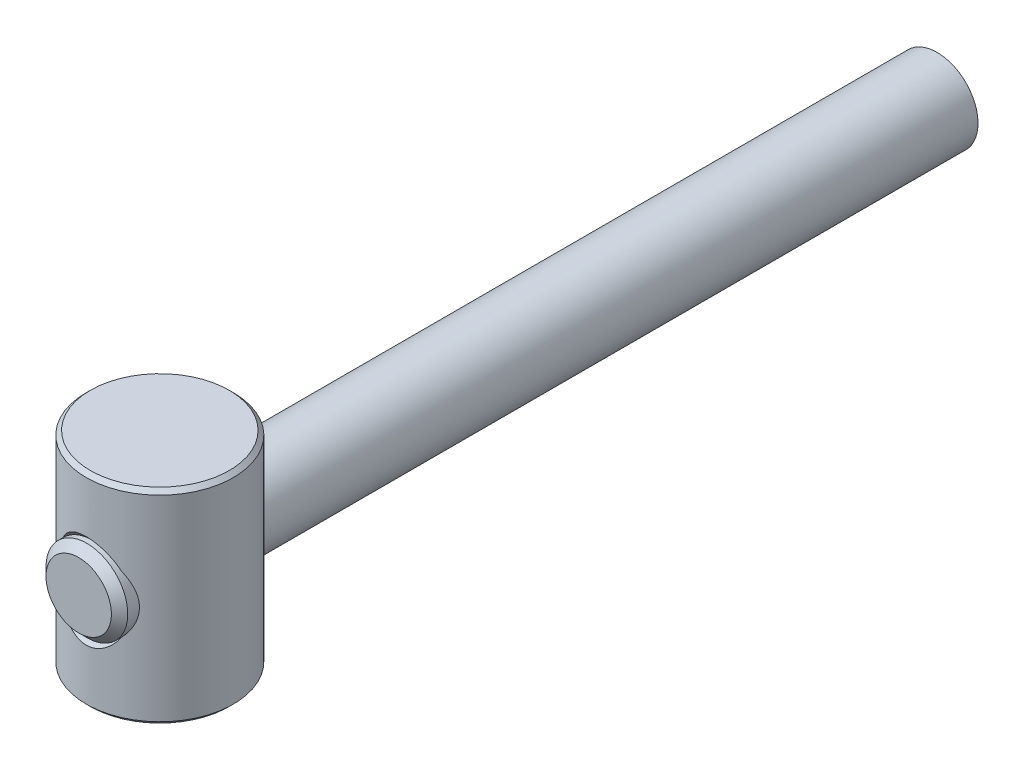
ISO-10303-21;
HEADER;
FILE_DESCRIPTION(('STEP AP214'),'2;1');
FILE_NAME('part.step','',(''),(''),'','','');
FILE_SCHEMA(('AUTOMOTIVE_DESIGN { 1 0 10303 214 1 1 1 1 }'));
ENDSEC;
DATA;
#1=APPLICATION_CONTEXT('core data for automotive mechanical design processes');
#2=APPLICATION_PROTOCOL_DEFINITION('international standard','automotive_design',2000,#1);
#3=PRODUCT_CONTEXT('',#1,'mechanical');
#4=PRODUCT('Part','Part','',(#3));
#5=PRODUCT_RELATED_PRODUCT_CATEGORY('part','',(#4));
#6=PRODUCT_DEFINITION_FORMATION('','',#4);
#7=PRODUCT_DEFINITION_CONTEXT('part definition',#1,'design');
#8=PRODUCT_DEFINITION('design','',#6,#7);
#9=PRODUCT_DEFINITION_SHAPE('','',#8);
#10=(LENGTH_UNIT() NAMED_UNIT(*) SI_UNIT(.MILLI.,.METRE.));
#11=(NAMED_UNIT(*) PLANE_ANGLE_UNIT() SI_UNIT($,.RADIAN.));
#12=(NAMED_UNIT(*) SI_UNIT($,.STERADIAN.) SOLID_ANGLE_UNIT());
#13=UNCERTAINTY_MEASURE_WITH_UNIT(LENGTH_MEASURE(1.E-05),#10,'distance_accuracy_value','');
#14=(GEOMETRIC_REPRESENTATION_CONTEXT(3) GLOBAL_UNCERTAINTY_ASSIGNED_CONTEXT((#13)) GLOBAL_UNIT_ASSIGNED_CONTEXT((#10,
#11,#12)) REPRESENTATION_CONTEXT('',''));
#15=CARTESIAN_POINT('',(0.,0.,0.));
#16=DIRECTION('',(0.,0.,1.));
#17=DIRECTION('',(1.,0.,0.));
#18=AXIS2_PLACEMENT_3D('',#15,#16,#17);
#19=CARTESIAN_POINT('',(0.,0.,-7.5));
#20=DIRECTION('',(0.,0.,-1.));
#21=DIRECTION('',(0.,-1.,0.));
#22=AXIS2_PLACEMENT_3D('',#19,#20,#21);
#23=CONICAL_SURFACE('',#22,4.25,0.785398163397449);
#24=CARTESIAN_POINT('',(0.,0.,-8.25));
#25=DIRECTION('',(0.,0.,-1.));
#26=DIRECTION('',(1.,0.,0.));
#27=AXIS2_PLACEMENT_3D('',#24,#25,#26);
#28=CIRCLE('',#27,5.);
#29=CARTESIAN_POINT('',(3.59687364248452,-3.47311099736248,-8.25));
#30=VERTEX_POINT('',#29);
#31=CARTESIAN_POINT('',(-3.59687364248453,-3.47311099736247,-8.25));
#32=VERTEX_POINT('',#31);
#33=EDGE_CURVE('E81',#30,#32,#28,.T.);
#34=ORIENTED_EDGE('',*,*,#33,.F.);
#35=CARTESIAN_POINT('',(1.46068104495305,-5.43791559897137,-8.8806762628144));
#36=CARTESIAN_POINT('',(1.2863171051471,-5.51444469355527,-8.90935366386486));
#37=CARTESIAN_POINT('',(1.1056925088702,-5.5784441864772,-8.93376470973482));
#38=CARTESIAN_POINT('',(0.735521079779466,-5.6775442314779,-8.97181912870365));
#39=CARTESIAN_POINT('',(0.545977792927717,-5.71265616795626,-8.98546674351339));
#40=CARTESIAN_POINT('',(0.162503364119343,-5.75152448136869,-9.00058493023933));
#41=CARTESIAN_POINT('',(-0.0314408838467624,-5.75516995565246,-9.00201243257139));
#42=CARTESIAN_POINT('',(-0.41689377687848,-5.73049886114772,-8.99240325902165));
#43=CARTESIAN_POINT('',(-0.608403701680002,-5.70219985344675,-8.98137343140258));
#44=CARTESIAN_POINT('',(-0.910252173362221,-5.63272434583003,-8.95459363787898));
#45=CARTESIAN_POINT('',(-1.02317021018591,-5.60084801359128,-8.94235212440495));
#46=CARTESIAN_POINT('',(-1.2450582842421,-5.52684625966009,-8.91416320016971));
#47=CARTESIAN_POINT('',(-1.35403034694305,-5.4847261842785,-8.8982177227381));
#48=CARTESIAN_POINT('',(-1.58810052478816,-5.38198928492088,-8.85971884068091));
#49=CARTESIAN_POINT('',(-1.71220649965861,-5.31936775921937,-8.8364833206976));
#50=CARTESIAN_POINT('',(-1.95298851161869,-5.18230289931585,-8.78640933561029));
#51=CARTESIAN_POINT('',(-2.06965813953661,-5.1078495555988,-8.7595678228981));
#52=CARTESIAN_POINT('',(-2.40849001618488,-4.86845627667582,-8.67487574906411));
#53=CARTESIAN_POINT('',(-2.6187049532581,-4.6878358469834,-8.61299448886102));
#54=CARTESIAN_POINT('',(-3.03422423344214,-4.26649333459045,-8.4763399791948));
#55=CARTESIAN_POINT('',(-3.23423861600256,-4.02083668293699,-8.40101083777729));
#56=CARTESIAN_POINT('',(-3.59116023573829,-3.49934558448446,-8.25473683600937));
#57=CARTESIAN_POINT('',(-3.74808345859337,-3.22352238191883,-8.18379035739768));
#58=CARTESIAN_POINT('',(-4.02196663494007,-2.64394855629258,-8.05278353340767));
#59=CARTESIAN_POINT('',(-4.13817100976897,-2.33979040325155,-7.99293782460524));
#60=CARTESIAN_POINT('',(-4.27920602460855,-1.87150935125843,-7.91777443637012));
#61=CARTESIAN_POINT('',(-4.32068093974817,-1.71335211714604,-7.89514892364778));
#62=CARTESIAN_POINT('',(-4.3924571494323,-1.39385270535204,-7.85544549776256));
#63=CARTESIAN_POINT('',(-4.42276195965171,-1.23251154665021,-7.83836583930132));
#64=CARTESIAN_POINT('',(-4.47426614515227,-0.893296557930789,-7.80909074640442));
#65=CARTESIAN_POINT('',(-4.49443058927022,-0.715216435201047,-7.79745682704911));
#66=CARTESIAN_POINT('',(-4.52131118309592,-0.357697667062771,-7.78190132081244));
#67=CARTESIAN_POINT('',(-4.52802662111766,-0.178258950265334,-7.77798014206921));
#68=CARTESIAN_POINT('',(-4.52796766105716,0.180604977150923,-7.77801444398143));
#69=CARTESIAN_POINT('',(-4.52119404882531,0.360030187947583,-7.78196946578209));
#70=CARTESIAN_POINT('',(-4.49419825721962,0.717521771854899,-7.7975909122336));
#71=CARTESIAN_POINT('',(-4.47397639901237,0.895588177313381,-7.80925715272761));
#72=CARTESIAN_POINT('',(-4.42092099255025,1.24425864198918,-7.83941056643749));
#73=CARTESIAN_POINT('',(-4.38844460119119,1.41493407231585,-7.85770403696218));
#74=CARTESIAN_POINT('',(-4.31097322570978,1.75270910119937,-7.90047255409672));
#75=CARTESIAN_POINT('',(-4.26597255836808,1.91980703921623,-7.92495040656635));
#76=CARTESIAN_POINT('',(-4.16351755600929,2.24945480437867,-7.97925332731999));
#77=CARTESIAN_POINT('',(-4.10604957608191,2.41199942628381,-8.00908424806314));
#78=CARTESIAN_POINT('',(-3.97876502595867,2.73129767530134,-8.07307272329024));
#79=CARTESIAN_POINT('',(-3.90894806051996,2.88805111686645,-8.10723041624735));
#80=CARTESIAN_POINT('',(-3.75472434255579,3.19919587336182,-8.17982367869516));
#81=CARTESIAN_POINT('',(-3.66995114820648,3.35338461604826,-8.21835502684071));
#82=CARTESIAN_POINT('',(-3.4872902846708,3.65314851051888,-8.29751295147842));
#83=CARTESIAN_POINT('',(-3.38940007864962,3.79872198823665,-8.33813993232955));
#84=CARTESIAN_POINT('',(-3.07610672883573,4.21982953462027,-8.46095964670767));
#85=CARTESIAN_POINT('',(-2.84054276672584,4.48086156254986,-8.54436444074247));
#86=CARTESIAN_POINT('',(-2.41080316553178,4.86244867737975,-8.67286797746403));
#87=CARTESIAN_POINT('',(-2.2322245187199,4.99975765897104,-8.72095311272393));
#88=CARTESIAN_POINT('',(-1.85425264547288,5.24531346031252,-8.80904132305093));
#89=CARTESIAN_POINT('',(-1.65489347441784,5.3536068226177,-8.84905731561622));
#90=CARTESIAN_POINT('',(-1.27038172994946,5.52058971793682,-8.91168045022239));
#91=CARTESIAN_POINT('',(-1.08771698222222,5.58433170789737,-8.93601381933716));
#92=CARTESIAN_POINT('',(-0.713485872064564,5.68224934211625,-8.97363911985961));
#93=CARTESIAN_POINT('',(-0.521924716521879,5.71644205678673,-8.98693742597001));
#94=CARTESIAN_POINT('',(-0.134655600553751,5.75280077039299,-9.00108365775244));
#95=CARTESIAN_POINT('',(0.0610637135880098,5.75486343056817,-9.00189141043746));
#96=CARTESIAN_POINT('',(0.449762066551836,5.72652857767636,-8.99085871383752));
#97=CARTESIAN_POINT('',(0.642740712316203,5.6961264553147,-8.97901646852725));
#98=CARTESIAN_POINT('',(1.01115907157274,5.60737887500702,-8.94484168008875));
#99=CARTESIAN_POINT('',(1.18699598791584,5.55044607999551,-8.92304045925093));
#100=CARTESIAN_POINT('',(1.52760202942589,5.41259472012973,-8.87108659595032));
#101=CARTESIAN_POINT('',(1.69236637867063,5.3316658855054,-8.8409303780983));
#102=CARTESIAN_POINT('',(2.07347582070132,5.11215493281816,-8.76085325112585));
#103=CARTESIAN_POINT('',(2.2834021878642,4.963525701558,-8.70789040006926));
#104=CARTESIAN_POINT('',(2.67518980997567,4.6348471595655,-8.59564583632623));
#105=CARTESIAN_POINT('',(2.85698739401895,4.45472847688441,-8.53635028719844));
#106=CARTESIAN_POINT('',(3.24018899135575,4.01515503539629,-8.39961868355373));
#107=CARTESIAN_POINT('',(3.43232586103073,3.74774434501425,-8.32184538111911));
#108=CARTESIAN_POINT('',(3.77054698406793,3.1832733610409,-8.1741730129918));
#109=CARTESIAN_POINT('',(3.91660385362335,2.88619557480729,-8.10427864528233));
#110=CARTESIAN_POINT('',(4.10191528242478,2.4228771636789,-8.01118387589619));
#111=CARTESIAN_POINT('',(4.15829708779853,2.26445708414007,-7.98196740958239));
#112=CARTESIAN_POINT('',(4.25923321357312,1.943082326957,-7.92856946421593));
#113=CARTESIAN_POINT('',(4.30379150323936,1.78012919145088,-7.90438629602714));
#114=CARTESIAN_POINT('',(4.3809634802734,1.45076081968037,-7.86187613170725));
#115=CARTESIAN_POINT('',(4.41358298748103,1.28434731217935,-7.84354628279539));
#116=CARTESIAN_POINT('',(4.4667944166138,0.949021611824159,-7.81336583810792));
#117=CARTESIAN_POINT('',(4.48738620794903,0.780109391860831,-7.80151531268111));
#118=CARTESIAN_POINT('',(4.517127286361,0.43293646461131,-7.7843352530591));
#119=CARTESIAN_POINT('',(4.52569439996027,0.254608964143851,-7.7793377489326));
#120=CARTESIAN_POINT('',(4.52948987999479,-0.102241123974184,-7.7771283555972));
#121=CARTESIAN_POINT('',(4.5247177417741,-0.280763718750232,-7.77991676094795));
#122=CARTESIAN_POINT('',(4.50185685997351,-0.636736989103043,-7.79316742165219));
#123=CARTESIAN_POINT('',(4.48376288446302,-0.814187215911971,-7.8036326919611));
#124=CARTESIAN_POINT('',(4.4343500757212,-1.16664271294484,-7.83181617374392));
#125=CARTESIAN_POINT('',(4.40303145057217,-1.3416480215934,-7.84953427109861));
#126=CARTESIAN_POINT('',(4.32804739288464,-1.68457153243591,-7.89112209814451));
#127=CARTESIAN_POINT('',(4.28463901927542,-1.85256145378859,-7.91486292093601));
#128=CARTESIAN_POINT('',(4.18536369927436,-2.18395440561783,-7.96780228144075));
#129=CARTESIAN_POINT('',(4.12949163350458,-2.34735552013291,-7.99700306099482));
#130=CARTESIAN_POINT('',(3.94326807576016,-2.8291113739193,-8.0913641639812));
#131=CARTESIAN_POINT('',(3.79425779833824,-3.13925595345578,-8.1633142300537));
#132=CARTESIAN_POINT('',(3.46986139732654,-3.68852677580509,-8.30584570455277));
#133=CARTESIAN_POINT('',(3.30063235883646,-3.93160999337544,-8.37533285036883));
#134=CARTESIAN_POINT('',(2.92426155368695,-4.3864204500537,-8.51403351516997));
#135=CARTESIAN_POINT('',(2.71719856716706,-4.59821122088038,-8.58324730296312));
#136=CARTESIAN_POINT('',(2.33654178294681,-4.91983775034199,-8.69289848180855));
#137=CARTESIAN_POINT('',(2.17293911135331,-5.04077825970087,-8.73553451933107));
#138=CARTESIAN_POINT('',(1.82886114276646,-5.25861254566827,-8.81398384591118));
#139=CARTESIAN_POINT('',(1.64839927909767,-5.35552524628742,-8.84980249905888));
#140=CARTESIAN_POINT('',(1.46068104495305,-5.43791559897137,-8.8806762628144));
#141=B_SPLINE_CURVE_WITH_KNOTS('',3,(#35,#36,#37,#38,#39,#40,#41,#42,#43,#44,#45,#46,#47,#48,
#49,#50,#51,#52,#53,#54,#55,#56,#57,#58,#59,#60,#61,#62,#63,#64,#65,#66,#67,#68,#69,#70,#71,#72,
#73,#74,#75,#76,#77,#78,#79,#80,#81,#82,#83,#84,#85,#86,#87,#88,#89,#90,#91,#92,#93,#94,#95,#96,
#97,#98,#99,#100,#101,#102,#103,#104,#105,#106,#107,#108,#109,#110,#111,#112,#113,#114,#115,
#116,#117,#118,#119,#120,#121,#122,#123,#124,#125,#126,#127,#128,#129,#130,#131,#132,#133,#134,
#135,#136,#137,#138,#139,#140),.UNSPECIFIED.,.T.,.F.,(4,2,2,2,2,2,2,2,2,2,2,2,2,2,2,2,2,2,2,2,2,
2,2,2,2,2,2,2,2,2,2,2,2,2,2,2,2,2,2,2,2,2,2,2,2,2,2,2,2,2,2,2,4),(0.,0.577108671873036,
1.15398979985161,1.7329033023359,2.31149870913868,2.66487811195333,3.01807347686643,
3.44004886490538,3.86238315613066,4.70958255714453,5.6816445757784,6.6533454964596,
7.64222559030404,8.1370047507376,8.63162805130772,9.16974299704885,9.70788641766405,
10.2459984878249,10.7840977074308,11.3075936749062,11.8313275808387,12.355637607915,
12.8799644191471,13.4195990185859,13.9593381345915,15.035073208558,15.7238147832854,
16.4114448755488,16.9939464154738,17.5761112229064,18.1601480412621,18.7442677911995,
19.3003245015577,19.8566195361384,20.6401266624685,21.4253821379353,22.4352603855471,
23.4457376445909,23.9573099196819,24.4687102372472,24.979860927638,25.4910171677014,
26.0261552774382,26.5613136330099,27.0966822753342,27.632042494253,28.1567902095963,
28.6817538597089,29.7309552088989,30.6404022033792,31.5479766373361,32.1697765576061,
32.7910851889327),.UNSPECIFIED.);
#142=EDGE_CURVE('E73',#30,#32,#141,.T.);
#143=ORIENTED_EDGE('',*,*,#142,.T.);
#144=EDGE_LOOP('',(#34,#143));
#145=FACE_BOUND('',#144,.T.);
#146=ADVANCED_FACE('F14',(#145),#23,.F.);
#147=CARTESIAN_POINT('',(0.,0.,9.));
#148=DIRECTION('',(0.,0.,1.));
#149=DIRECTION('',(0.,1.,0.));
#150=AXIS2_PLACEMENT_3D('',#147,#148,#149);
#151=CONICAL_SURFACE('',#150,5.75,0.785398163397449);
#152=CARTESIAN_POINT('',(0.,0.,8.25));
#153=DIRECTION('',(0.,0.,1.));
#154=DIRECTION('',(-1.,0.,0.));
#155=AXIS2_PLACEMENT_3D('',#152,#153,#154);
#156=CIRCLE('',#155,5.);
#157=CARTESIAN_POINT('',(-3.59687364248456,-3.47311099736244,8.25));
#158=VERTEX_POINT('',#157);
#159=CARTESIAN_POINT('',(3.59687364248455,-3.47311099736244,8.25));
#160=VERTEX_POINT('',#159);
#161=EDGE_CURVE('E28',#158,#160,#156,.T.);
#162=ORIENTED_EDGE('',*,*,#161,.F.);
#163=CARTESIAN_POINT('',(-1.46180973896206,-5.43741998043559,8.88049054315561));
#164=CARTESIAN_POINT('',(-1.287454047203,-5.51401113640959,8.90918931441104));
#165=CARTESIAN_POINT('',(-1.10683297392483,-5.57807473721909,8.93362356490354));
#166=CARTESIAN_POINT('',(-0.736657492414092,-5.67730360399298,8.9717259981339));
#167=CARTESIAN_POINT('',(-0.547106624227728,-5.71248022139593,8.98539840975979));
#168=CARTESIAN_POINT('',(-0.16360365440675,-5.75147433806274,9.00056531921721));
#169=CARTESIAN_POINT('',(0.0303616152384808,-5.7551807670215,9.00201668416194));
#170=CARTESIAN_POINT('',(0.415867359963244,-5.73062243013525,8.99245134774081));
#171=CARTESIAN_POINT('',(0.607409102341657,-5.70237513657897,8.98144146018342));
#172=CARTESIAN_POINT('',(0.909662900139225,-5.63289277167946,8.9546582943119));
#173=CARTESIAN_POINT('',(1.02294273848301,-5.60092811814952,8.94238256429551));
#174=CARTESIAN_POINT('',(1.24552941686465,-5.52668489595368,8.91410180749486));
#175=CARTESIAN_POINT('',(1.35483828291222,-5.4844116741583,8.89809871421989));
#176=CARTESIAN_POINT('',(1.58920447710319,-5.38145650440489,8.85952057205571));
#177=CARTESIAN_POINT('',(1.71328407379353,-5.31880083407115,8.83627412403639));
#178=CARTESIAN_POINT('',(1.95401206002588,-5.1816732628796,8.78618141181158));
#179=CARTESIAN_POINT('',(2.07065405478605,-5.10719138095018,8.75933210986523));
#180=CARTESIAN_POINT('',(2.40940084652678,-4.86772103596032,8.67462141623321));
#181=CARTESIAN_POINT('',(2.61955811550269,-4.68706001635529,8.61273382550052));
#182=CARTESIAN_POINT('',(3.03500341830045,-4.26560006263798,8.47606066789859));
#183=CARTESIAN_POINT('',(3.23499311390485,-4.01986048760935,8.4007197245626));
#184=CARTESIAN_POINT('',(3.59185378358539,-3.49820564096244,8.25443447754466));
#185=CARTESIAN_POINT('',(3.74874064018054,-3.22230153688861,8.1834885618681));
#186=CARTESIAN_POINT('',(4.02253465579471,-2.64257318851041,8.0524989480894));
#187=CARTESIAN_POINT('',(4.13868683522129,-2.33834191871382,7.99266991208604));
#188=CARTESIAN_POINT('',(4.27963351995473,-1.86995672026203,7.9175431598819));
#189=CARTESIAN_POINT('',(4.32107729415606,-1.71176576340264,7.89493181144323));
#190=CARTESIAN_POINT('',(4.39278781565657,-1.39220119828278,7.85526040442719));
#191=CARTESIAN_POINT('',(4.42305808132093,-1.23082860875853,7.83819859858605));
#192=CARTESIAN_POINT('',(4.47448258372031,-0.891577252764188,7.80896653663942));
#193=CARTESIAN_POINT('',(4.49460355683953,-0.713492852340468,7.79735702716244));
#194=CARTESIAN_POINT('',(4.52139729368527,-0.355969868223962,7.78185118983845));
#195=CARTESIAN_POINT('',(4.52806934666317,-0.176531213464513,7.77795526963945));
#196=CARTESIAN_POINT('',(4.52792395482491,0.18232831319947,7.77803988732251));
#197=CARTESIAN_POINT('',(4.52110728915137,0.361749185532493,7.78201997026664));
#198=CARTESIAN_POINT('',(4.49402595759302,0.719227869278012,7.79769031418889));
#199=CARTESIAN_POINT('',(4.47376161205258,0.897285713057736,7.80938039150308));
#200=CARTESIAN_POINT('',(4.42062283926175,1.24593707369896,7.83957887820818));
#201=CARTESIAN_POINT('',(4.38810542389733,1.41660204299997,7.8578937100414));
#202=CARTESIAN_POINT('',(4.3105524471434,1.75435256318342,7.90070239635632));
#203=CARTESIAN_POINT('',(4.26551120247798,1.92143645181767,7.92519905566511));
#204=CARTESIAN_POINT('',(4.16297530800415,2.25105288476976,7.97953656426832));
#205=CARTESIAN_POINT('',(4.10546699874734,2.41358021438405,8.00938326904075));
#206=CARTESIAN_POINT('',(3.9781019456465,2.73284044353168,8.07339985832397));
#207=CARTESIAN_POINT('',(3.90824480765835,2.88957315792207,8.10756988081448));
#208=CARTESIAN_POINT('',(3.75393791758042,3.20067526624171,8.1801850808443));
#209=CARTESIAN_POINT('',(3.66912146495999,3.35484184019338,8.21872599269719));
#210=CARTESIAN_POINT('',(3.48637328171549,3.65455666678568,8.29789881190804));
#211=CARTESIAN_POINT('',(3.38843901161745,3.80010324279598,8.33853112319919));
#212=CARTESIAN_POINT('',(3.0750126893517,4.22112073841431,8.46135952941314));
#213=CARTESIAN_POINT('',(2.83935805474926,4.48208156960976,8.5447608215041));
#214=CARTESIAN_POINT('',(2.40951927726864,4.86348041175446,8.6732247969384));
#215=CARTESIAN_POINT('',(2.23093815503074,5.00068923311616,8.72128200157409));
#216=CARTESIAN_POINT('',(1.85297709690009,5.24604608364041,8.80930945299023));
#217=CARTESIAN_POINT('',(1.65363118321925,5.35424064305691,8.84929262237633));
#218=CARTESIAN_POINT('',(1.26913542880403,5.52105790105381,8.91185808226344));
#219=CARTESIAN_POINT('',(1.08646886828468,5.58472841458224,8.9361655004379));
#220=CARTESIAN_POINT('',(0.712246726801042,5.68250313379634,8.97373741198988));
#221=CARTESIAN_POINT('',(0.520696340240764,5.71662439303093,8.98700827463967));
#222=CARTESIAN_POINT('',(0.133464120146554,5.7528450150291,9.00110097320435));
#223=CARTESIAN_POINT('',(-0.0622289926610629,5.75484133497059,9.00188274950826));
#224=CARTESIAN_POINT('',(-0.450863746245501,5.72638502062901,8.99080287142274));
#225=CARTESIAN_POINT('',(-0.643804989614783,5.6959277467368,8.97893940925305));
#226=CARTESIAN_POINT('',(-1.0121746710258,5.60707893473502,8.94472668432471));
#227=CARTESIAN_POINT('',(-1.18799930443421,5.55009474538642,8.92290669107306));
#228=CARTESIAN_POINT('',(-1.52857472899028,5.41214589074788,8.87091879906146));
#229=CARTESIAN_POINT('',(-1.69332073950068,5.33117095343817,8.84074732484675));
#230=CARTESIAN_POINT('',(-2.07442383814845,5.1115314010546,8.7606293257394));
#231=CARTESIAN_POINT('',(-2.2843555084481,4.96281476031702,8.70764047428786));
#232=CARTESIAN_POINT('',(-2.67613987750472,4.63396043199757,8.59535020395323));
#233=CARTESIAN_POINT('',(-2.85792885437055,4.45375334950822,8.53603495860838));
#234=CARTESIAN_POINT('',(-3.24108012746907,4.01399729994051,8.39927407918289));
#235=CARTESIAN_POINT('',(-3.43317498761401,3.74649559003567,8.32149411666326));
#236=CARTESIAN_POINT('',(-3.77129963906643,3.18184801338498,8.17382477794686));
#237=CARTESIAN_POINT('',(-3.91730209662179,2.88468469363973,8.10394009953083));
#238=CARTESIAN_POINT('',(-4.10251999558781,2.42124551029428,8.01087392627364));
#239=CARTESIAN_POINT('',(-4.15886804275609,2.26278774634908,7.98166966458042));
#240=CARTESIAN_POINT('',(-4.25973332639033,1.94133995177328,7.92830051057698));
#241=CARTESIAN_POINT('',(-4.30425453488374,1.77835146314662,7.90413392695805));
#242=CARTESIAN_POINT('',(-4.38134889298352,1.44891530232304,7.86166111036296));
#243=CARTESIAN_POINT('',(-4.41392786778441,1.28246935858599,7.84335202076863));
#244=CARTESIAN_POINT('',(-4.46705475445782,0.947082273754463,7.81321681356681));
#245=CARTESIAN_POINT('',(-4.48760253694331,0.778141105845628,7.80139076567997));
#246=CARTESIAN_POINT('',(-4.51724771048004,0.430941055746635,7.78426524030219));
#247=CARTESIAN_POINT('',(-4.52576485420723,0.2526158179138,7.77929674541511));
#248=CARTESIAN_POINT('',(-4.52946116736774,-0.104224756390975,7.77714506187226));
#249=CARTESIAN_POINT('',(-4.52463983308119,-0.282740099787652,7.77996216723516));
#250=CARTESIAN_POINT('',(-4.50168158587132,-0.6386942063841,7.79326876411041));
#251=CARTESIAN_POINT('',(-4.48353943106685,-0.816132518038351,7.80376127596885));
#252=CARTESIAN_POINT('',(-4.43403149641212,-1.16855972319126,7.83199674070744));
#253=CARTESIAN_POINT('',(-4.40266592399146,-1.34354865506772,7.84973957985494));
#254=CARTESIAN_POINT('',(-4.32758841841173,-1.68644367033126,7.89137409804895));
#255=CARTESIAN_POINT('',(-4.28413292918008,-1.85442138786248,7.9151372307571));
#256=CARTESIAN_POINT('',(-4.18476334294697,-2.18578581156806,7.96811797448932));
#257=CARTESIAN_POINT('',(-4.12884412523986,-2.34917059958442,7.99733782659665));
#258=CARTESIAN_POINT('',(-3.94247861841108,-2.83087160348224,8.09175056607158));
#259=CARTESIAN_POINT('',(-3.79337301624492,-3.14097163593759,8.16372763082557));
#260=CARTESIAN_POINT('',(-3.46884128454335,-3.69006400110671,8.30627246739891));
#261=CARTESIAN_POINT('',(-3.29958378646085,-3.93302298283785,8.37574627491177));
#262=CARTESIAN_POINT('',(-2.92317778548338,-4.38758401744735,8.51440585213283));
#263=CARTESIAN_POINT('',(-2.71610841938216,-4.5992499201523,8.58359192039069));
#264=CARTESIAN_POINT('',(-2.3357532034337,-4.92042313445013,8.69310461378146));
#265=CARTESIAN_POINT('',(-2.17248484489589,-5.04107124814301,8.73563973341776));
#266=CARTESIAN_POINT('',(-1.82914844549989,-5.25842527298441,8.81391670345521));
#267=CARTESIAN_POINT('',(-1.64909357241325,-5.35514973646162,8.84966381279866));
#268=CARTESIAN_POINT('',(-1.46180973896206,-5.43741998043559,8.88049054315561));
#269=B_SPLINE_CURVE_WITH_KNOTS('',3,(#163,#164,#165,#166,#167,#168,#169,#170,#171,#172,#173,
#174,#175,#176,#177,#178,#179,#180,#181,#182,#183,#184,#185,#186,#187,#188,#189,#190,#191,#192,
#193,#194,#195,#196,#197,#198,#199,#200,#201,#202,#203,#204,#205,#206,#207,#208,#209,#210,#211,
#212,#213,#214,#215,#216,#217,#218,#219,#220,#221,#222,#223,#224,#225,#226,#227,#228,#229,#230,
#231,#232,#233,#234,#235,#236,#237,#238,#239,#240,#241,#242,#243,#244,#245,#246,#247,#248,#249,
#250,#251,#252,#253,#254,#255,#256,#257,#258,#259,#260,#261,#262,#263,#264,#265,#266,#267,#268),
.UNSPECIFIED.,.T.,.F.,(4,2,2,2,2,2,2,2,2,2,2,2,2,2,2,2,2,2,2,2,2,2,2,2,2,2,2,2,2,2,2,2,2,2,2,2,
2,2,2,2,2,2,2,2,2,2,2,2,2,2,2,2,4),(0.,0.577170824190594,1.15411473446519,1.73309405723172,
2.31175694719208,2.66625190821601,3.02056338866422,3.44252098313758,3.86483661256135,
4.71199264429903,5.68420414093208,6.65605691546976,7.64507280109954,8.13991940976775,
8.63461006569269,9.17271836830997,9.71085510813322,10.2489607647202,10.7870536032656,
11.3105485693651,11.8342814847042,12.3585911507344,12.8829175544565,13.4225622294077,
13.9623115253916,15.0380620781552,15.7266132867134,16.4140535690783,16.9964802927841,
17.5785706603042,18.1625277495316,18.7465683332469,19.3026444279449,19.8589589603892,
20.6426419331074,21.4280741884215,22.4381009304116,23.4487255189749,23.9603628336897,
24.4718280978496,24.983043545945,25.4942644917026,26.0293862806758,26.5645282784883,
27.0998809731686,27.6352252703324,28.1599819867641,28.6849546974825,29.7341745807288,
30.6433641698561,31.5506722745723,32.1711218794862,32.7910888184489),.UNSPECIFIED.);
#270=EDGE_CURVE('E36',#158,#160,#269,.T.);
#271=ORIENTED_EDGE('',*,*,#270,.T.);
#272=EDGE_LOOP('',(#162,#271));
#273=FACE_BOUND('',#272,.T.);
#274=ADVANCED_FACE('F145',(#273),#151,.F.);
#275=CARTESIAN_POINT('',(-3.59687364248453,3.47311099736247,-8.25));
#276=VERTEX_POINT('',#275);
#277=CARTESIAN_POINT('',(3.59687364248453,3.47311099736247,-8.25));
#278=VERTEX_POINT('',#277);
#279=EDGE_CURVE('E64',#276,#278,#28,.T.);
#280=ORIENTED_EDGE('',*,*,#279,.F.);
#281=CARTESIAN_POINT('',(-1.46068104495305,5.43791559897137,-8.8806762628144));
#282=CARTESIAN_POINT('',(-1.2863171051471,5.51444469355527,-8.90935366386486));
#283=CARTESIAN_POINT('',(-1.1056925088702,5.5784441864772,-8.93376470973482));
#284=CARTESIAN_POINT('',(-0.735521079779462,5.6775442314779,-8.97181912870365));
#285=CARTESIAN_POINT('',(-0.545977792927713,5.71265616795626,-8.98546674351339));
#286=CARTESIAN_POINT('',(-0.162503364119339,5.75152448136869,-9.00058493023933));
#287=CARTESIAN_POINT('',(0.0314408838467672,5.75516995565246,-9.00201243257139));
#288=CARTESIAN_POINT('',(0.416893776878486,5.73049886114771,-8.99240325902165));
#289=CARTESIAN_POINT('',(0.608403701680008,5.70219985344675,-8.98137343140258));
#290=CARTESIAN_POINT('',(0.910252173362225,5.63272434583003,-8.95459363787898));
#291=CARTESIAN_POINT('',(1.02317021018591,5.60084801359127,-8.94235212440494));
#292=CARTESIAN_POINT('',(1.24505828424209,5.52684625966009,-8.91416320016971));
#293=CARTESIAN_POINT('',(1.35403034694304,5.4847261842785,-8.8982177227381));
#294=CARTESIAN_POINT('',(1.58810052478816,5.38198928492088,-8.85971884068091));
#295=CARTESIAN_POINT('',(1.7122064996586,5.31936775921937,-8.8364833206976));
#296=CARTESIAN_POINT('',(1.95298851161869,5.18230289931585,-8.78640933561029));
#297=CARTESIAN_POINT('',(2.06965813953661,5.1078495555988,-8.7595678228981));
#298=CARTESIAN_POINT('',(2.40849001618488,4.86845627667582,-8.67487574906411));
#299=CARTESIAN_POINT('',(2.61870495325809,4.6878358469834,-8.61299448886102));
#300=CARTESIAN_POINT('',(3.03422423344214,4.26649333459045,-8.4763399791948));
#301=CARTESIAN_POINT('',(3.23423861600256,4.02083668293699,-8.40101083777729));
#302=CARTESIAN_POINT('',(3.59116023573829,3.49934558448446,-8.25473683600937));
#303=CARTESIAN_POINT('',(3.74808345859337,3.22352238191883,-8.18379035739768));
#304=CARTESIAN_POINT('',(4.02196663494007,2.64394855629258,-8.05278353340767));
#305=CARTESIAN_POINT('',(4.13817100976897,2.33979040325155,-7.99293782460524));
#306=CARTESIAN_POINT('',(4.27920602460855,1.87150935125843,-7.91777443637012));
#307=CARTESIAN_POINT('',(4.32068093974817,1.71335211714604,-7.89514892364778));
#308=CARTESIAN_POINT('',(4.39245714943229,1.39385270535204,-7.85544549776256));
#309=CARTESIAN_POINT('',(4.4227619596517,1.23251154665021,-7.83836583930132));
#310=CARTESIAN_POINT('',(4.47426614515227,0.893296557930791,-7.80909074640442));
#311=CARTESIAN_POINT('',(4.49443058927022,0.715216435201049,-7.79745682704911));
#312=CARTESIAN_POINT('',(4.52131118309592,0.357697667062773,-7.78190132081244));
#313=CARTESIAN_POINT('',(4.52802662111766,0.178258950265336,-7.77798014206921));
#314=CARTESIAN_POINT('',(4.52796766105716,-0.180604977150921,-7.77801444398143));
#315=CARTESIAN_POINT('',(4.52119404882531,-0.36003018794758,-7.78196946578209));
#316=CARTESIAN_POINT('',(4.49419825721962,-0.717521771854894,-7.7975909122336));
#317=CARTESIAN_POINT('',(4.47397639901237,-0.895588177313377,-7.80925715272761));
#318=CARTESIAN_POINT('',(4.42092099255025,-1.24425864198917,-7.83941056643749));
#319=CARTESIAN_POINT('',(4.38844460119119,-1.41493407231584,-7.85770403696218));
#320=CARTESIAN_POINT('',(4.31097322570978,-1.75270910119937,-7.90047255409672));
#321=CARTESIAN_POINT('',(4.26597255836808,-1.91980703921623,-7.92495040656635));
#322=CARTESIAN_POINT('',(4.16351755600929,-2.24945480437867,-7.97925332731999));
#323=CARTESIAN_POINT('',(4.10604957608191,-2.41199942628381,-8.00908424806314));
#324=CARTESIAN_POINT('',(3.97876502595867,-2.73129767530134,-8.07307272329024));
#325=CARTESIAN_POINT('',(3.90894806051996,-2.88805111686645,-8.10723041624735));
#326=CARTESIAN_POINT('',(3.75472434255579,-3.19919587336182,-8.17982367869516));
#327=CARTESIAN_POINT('',(3.66995114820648,-3.35338461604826,-8.2183550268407));
#328=CARTESIAN_POINT('',(3.4872902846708,-3.65314851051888,-8.29751295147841));
#329=CARTESIAN_POINT('',(3.38940007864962,-3.79872198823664,-8.33813993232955));
#330=CARTESIAN_POINT('',(3.07610672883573,-4.21982953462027,-8.46095964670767));
#331=CARTESIAN_POINT('',(2.84054276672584,-4.48086156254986,-8.54436444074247));
#332=CARTESIAN_POINT('',(2.41080316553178,-4.86244867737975,-8.67286797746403));
#333=CARTESIAN_POINT('',(2.2322245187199,-4.99975765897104,-8.72095311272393));
#334=CARTESIAN_POINT('',(1.85425264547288,-5.24531346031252,-8.80904132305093));
#335=CARTESIAN_POINT('',(1.65489347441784,-5.3536068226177,-8.84905731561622));
#336=CARTESIAN_POINT('',(1.27038172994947,-5.52058971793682,-8.91168045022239));
#337=CARTESIAN_POINT('',(1.08771698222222,-5.58433170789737,-8.93601381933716));
#338=CARTESIAN_POINT('',(0.713485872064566,-5.68224934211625,-8.97363911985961));
#339=CARTESIAN_POINT('',(0.521924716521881,-5.71644205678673,-8.98693742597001));
#340=CARTESIAN_POINT('',(0.134655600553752,-5.75280077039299,-9.00108365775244));
#341=CARTESIAN_POINT('',(-0.0610637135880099,-5.75486343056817,-9.00189141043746));
#342=CARTESIAN_POINT('',(-0.449762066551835,-5.72652857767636,-8.99085871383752));
#343=CARTESIAN_POINT('',(-0.642740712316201,-5.6961264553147,-8.97901646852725));
#344=CARTESIAN_POINT('',(-1.01115907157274,-5.60737887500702,-8.94484168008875));
#345=CARTESIAN_POINT('',(-1.18699598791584,-5.55044607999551,-8.92304045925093));
#346=CARTESIAN_POINT('',(-1.52760202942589,-5.41259472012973,-8.87108659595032));
#347=CARTESIAN_POINT('',(-1.69236637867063,-5.3316658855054,-8.8409303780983));
#348=CARTESIAN_POINT('',(-2.07347582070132,-5.11215493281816,-8.76085325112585));
#349=CARTESIAN_POINT('',(-2.2834021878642,-4.963525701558,-8.70789040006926));
#350=CARTESIAN_POINT('',(-2.67518980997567,-4.6348471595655,-8.59564583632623));
#351=CARTESIAN_POINT('',(-2.85698739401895,-4.45472847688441,-8.53635028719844));
#352=CARTESIAN_POINT('',(-3.24018899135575,-4.01515503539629,-8.39961868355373));
#353=CARTESIAN_POINT('',(-3.43232586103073,-3.74774434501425,-8.32184538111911));
#354=CARTESIAN_POINT('',(-3.77054698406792,-3.18327336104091,-8.1741730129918));
#355=CARTESIAN_POINT('',(-3.91660385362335,-2.8861955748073,-8.10427864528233));
#356=CARTESIAN_POINT('',(-4.10191528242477,-2.42287716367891,-8.01118387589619));
#357=CARTESIAN_POINT('',(-4.15829708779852,-2.26445708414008,-7.98196740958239));
#358=CARTESIAN_POINT('',(-4.25923321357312,-1.94308232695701,-7.92856946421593));
#359=CARTESIAN_POINT('',(-4.30379150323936,-1.78012919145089,-7.90438629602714));
#360=CARTESIAN_POINT('',(-4.3809634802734,-1.45076081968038,-7.86187613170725));
#361=CARTESIAN_POINT('',(-4.41358298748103,-1.28434731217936,-7.84354628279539));
#362=CARTESIAN_POINT('',(-4.4667944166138,-0.949021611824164,-7.81336583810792));
#363=CARTESIAN_POINT('',(-4.48738620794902,-0.780109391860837,-7.80151531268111));
#364=CARTESIAN_POINT('',(-4.517127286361,-0.432936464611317,-7.7843352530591));
#365=CARTESIAN_POINT('',(-4.52569439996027,-0.254608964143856,-7.7793377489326));
#366=CARTESIAN_POINT('',(-4.52948987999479,0.102241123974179,-7.7771283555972));
#367=CARTESIAN_POINT('',(-4.5247177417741,0.280763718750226,-7.77991676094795));
#368=CARTESIAN_POINT('',(-4.50185685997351,0.636736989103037,-7.79316742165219));
#369=CARTESIAN_POINT('',(-4.48376288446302,0.814187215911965,-7.8036326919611));
#370=CARTESIAN_POINT('',(-4.43435007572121,1.16664271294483,-7.83181617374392));
#371=CARTESIAN_POINT('',(-4.40303145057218,1.3416480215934,-7.84953427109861));
#372=CARTESIAN_POINT('',(-4.32804739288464,1.6845715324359,-7.89112209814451));
#373=CARTESIAN_POINT('',(-4.28463901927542,1.85256145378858,-7.91486292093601));
#374=CARTESIAN_POINT('',(-4.18536369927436,2.18395440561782,-7.96780228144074));
#375=CARTESIAN_POINT('',(-4.12949163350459,2.34735552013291,-7.99700306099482));
#376=CARTESIAN_POINT('',(-3.94326807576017,2.82911137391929,-8.0913641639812));
#377=CARTESIAN_POINT('',(-3.79425779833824,3.13925595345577,-8.16331423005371));
#378=CARTESIAN_POINT('',(-3.46986139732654,3.68852677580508,-8.30584570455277));
#379=CARTESIAN_POINT('',(-3.30063235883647,3.93160999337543,-8.37533285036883));
#380=CARTESIAN_POINT('',(-2.92426155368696,4.38642045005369,-8.51403351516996));
#381=CARTESIAN_POINT('',(-2.71719856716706,4.59821122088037,-8.58324730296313));
#382=CARTESIAN_POINT('',(-2.33654178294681,4.91983775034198,-8.69289848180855));
#383=CARTESIAN_POINT('',(-2.17293911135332,5.04077825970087,-8.73553451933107));
#384=CARTESIAN_POINT('',(-1.82886114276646,5.25861254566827,-8.81398384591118));
#385=CARTESIAN_POINT('',(-1.64839927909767,5.35552524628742,-8.84980249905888));
#386=CARTESIAN_POINT('',(-1.46068104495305,5.43791559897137,-8.8806762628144));
#387=B_SPLINE_CURVE_WITH_KNOTS('',3,(#281,#282,#283,#284,#285,#286,#287,#288,#289,#290,#291,
#292,#293,#294,#295,#296,#297,#298,#299,#300,#301,#302,#303,#304,#305,#306,#307,#308,#309,#310,
#311,#312,#313,#314,#315,#316,#317,#318,#319,#320,#321,#322,#323,#324,#325,#326,#327,#328,#329,
#330,#331,#332,#333,#334,#335,#336,#337,#338,#339,#340,#341,#342,#343,#344,#345,#346,#347,#348,
#349,#350,#351,#352,#353,#354,#355,#356,#357,#358,#359,#360,#361,#362,#363,#364,#365,#366,#367,
#368,#369,#370,#371,#372,#373,#374,#375,#376,#377,#378,#379,#380,#381,#382,#383,#384,#385,#386),
.UNSPECIFIED.,.T.,.F.,(4,2,2,2,2,2,2,2,2,2,2,2,2,2,2,2,2,2,2,2,2,2,2,2,2,2,2,2,2,2,2,2,2,2,2,2,
2,2,2,2,2,2,2,2,2,2,2,2,2,2,2,2,4),(0.,0.577108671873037,1.15398979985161,1.7329033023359,
2.31149870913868,2.66487811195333,3.01807347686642,3.44004886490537,3.86238315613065,
4.70958255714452,5.6816445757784,6.6533454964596,7.64222559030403,8.1370047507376,
8.63162805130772,9.16974299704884,9.70788641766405,10.2459984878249,10.7840977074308,
11.3075936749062,11.8313275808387,12.355637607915,12.8799644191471,13.4195990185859,
13.9593381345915,15.035073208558,15.7238147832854,16.4114448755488,16.9939464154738,
17.5761112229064,18.1601480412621,18.7442677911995,19.3003245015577,19.8566195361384,
20.6401266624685,21.4253821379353,22.4352603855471,23.4457376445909,23.9573099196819,
24.4687102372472,24.979860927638,25.4910171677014,26.0261552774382,26.5613136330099,
27.0966822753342,27.632042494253,28.1567902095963,28.6817538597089,29.7309552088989,
30.6404022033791,31.5479766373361,32.1697765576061,32.7910851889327),.UNSPECIFIED.);
#388=EDGE_CURVE('E60',#276,#278,#387,.T.);
#389=ORIENTED_EDGE('',*,*,#388,.T.);
#390=EDGE_LOOP('',(#280,#389));
#391=FACE_BOUND('',#390,.T.);
#392=ADVANCED_FACE('F62',(#391),#23,.F.);
#393=CARTESIAN_POINT('',(3.59687364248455,3.47311099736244,8.25));
#394=VERTEX_POINT('',#393);
#395=CARTESIAN_POINT('',(-3.59687364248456,3.47311099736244,8.25));
#396=VERTEX_POINT('',#395);
#397=EDGE_CURVE('E119',#394,#396,#156,.T.);
#398=ORIENTED_EDGE('',*,*,#397,.F.);
#399=CARTESIAN_POINT('',(1.46180973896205,5.43741998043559,8.88049054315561));
#400=CARTESIAN_POINT('',(1.28745404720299,5.51401113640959,8.90918931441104));
#401=CARTESIAN_POINT('',(1.10683297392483,5.5780747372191,8.93362356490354));
#402=CARTESIAN_POINT('',(0.736657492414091,5.67730360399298,8.9717259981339));
#403=CARTESIAN_POINT('',(0.547106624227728,5.71248022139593,8.98539840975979));
#404=CARTESIAN_POINT('',(0.16360365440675,5.75147433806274,9.00056531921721));
#405=CARTESIAN_POINT('',(-0.0303616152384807,5.7551807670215,9.00201668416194));
#406=CARTESIAN_POINT('',(-0.415867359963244,5.73062243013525,8.99245134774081));
#407=CARTESIAN_POINT('',(-0.607409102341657,5.70237513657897,8.98144146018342));
#408=CARTESIAN_POINT('',(-0.909662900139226,5.63289277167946,8.9546582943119));
#409=CARTESIAN_POINT('',(-1.02294273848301,5.60092811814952,8.94238256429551));
#410=CARTESIAN_POINT('',(-1.24552941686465,5.52668489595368,8.91410180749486));
#411=CARTESIAN_POINT('',(-1.35483828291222,5.4844116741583,8.89809871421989));
#412=CARTESIAN_POINT('',(-1.58920447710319,5.38145650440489,8.85952057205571));
#413=CARTESIAN_POINT('',(-1.71328407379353,5.31880083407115,8.83627412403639));
#414=CARTESIAN_POINT('',(-1.95401206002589,5.1816732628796,8.78618141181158));
#415=CARTESIAN_POINT('',(-2.07065405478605,5.10719138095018,8.75933210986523));
#416=CARTESIAN_POINT('',(-2.40940084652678,4.86772103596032,8.67462141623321));
#417=CARTESIAN_POINT('',(-2.61955811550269,4.68706001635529,8.61273382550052));
#418=CARTESIAN_POINT('',(-3.03500341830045,4.26560006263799,8.47606066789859));
#419=CARTESIAN_POINT('',(-3.23499311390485,4.01986048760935,8.4007197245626));
#420=CARTESIAN_POINT('',(-3.59185378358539,3.49820564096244,8.25443447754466));
#421=CARTESIAN_POINT('',(-3.74874064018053,3.22230153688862,8.1834885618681));
#422=CARTESIAN_POINT('',(-4.0225346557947,2.64257318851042,8.0524989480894));
#423=CARTESIAN_POINT('',(-4.13868683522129,2.33834191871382,7.99266991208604));
#424=CARTESIAN_POINT('',(-4.27963351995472,1.86995672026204,7.9175431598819));
#425=CARTESIAN_POINT('',(-4.32107729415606,1.71176576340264,7.89493181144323));
#426=CARTESIAN_POINT('',(-4.39278781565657,1.39220119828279,7.85526040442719));
#427=CARTESIAN_POINT('',(-4.42305808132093,1.23082860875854,7.83819859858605));
#428=CARTESIAN_POINT('',(-4.47448258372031,0.891577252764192,7.80896653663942));
#429=CARTESIAN_POINT('',(-4.49460355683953,0.713492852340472,7.79735702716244));
#430=CARTESIAN_POINT('',(-4.52139729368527,0.355969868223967,7.78185118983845));
#431=CARTESIAN_POINT('',(-4.52806934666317,0.176531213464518,7.77795526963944));
#432=CARTESIAN_POINT('',(-4.52792395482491,-0.182328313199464,7.77803988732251));
#433=CARTESIAN_POINT('',(-4.52110728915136,-0.361749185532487,7.78201997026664));
#434=CARTESIAN_POINT('',(-4.49402595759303,-0.719227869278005,7.79769031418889));
#435=CARTESIAN_POINT('',(-4.47376161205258,-0.897285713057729,7.80938039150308));
#436=CARTESIAN_POINT('',(-4.42062283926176,-1.24593707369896,7.83957887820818));
#437=CARTESIAN_POINT('',(-4.38810542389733,-1.41660204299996,7.8578937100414));
#438=CARTESIAN_POINT('',(-4.31055244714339,-1.75435256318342,7.90070239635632));
#439=CARTESIAN_POINT('',(-4.26551120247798,-1.92143645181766,7.92519905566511));
#440=CARTESIAN_POINT('',(-4.16297530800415,-2.25105288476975,7.97953656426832));
#441=CARTESIAN_POINT('',(-4.10546699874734,-2.41358021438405,8.00938326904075));
#442=CARTESIAN_POINT('',(-3.9781019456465,-2.73284044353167,8.07339985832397));
#443=CARTESIAN_POINT('',(-3.90824480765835,-2.88957315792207,8.10756988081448));
#444=CARTESIAN_POINT('',(-3.75393791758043,-3.2006752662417,8.1801850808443));
#445=CARTESIAN_POINT('',(-3.66912146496,-3.35484184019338,8.21872599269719));
#446=CARTESIAN_POINT('',(-3.48637328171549,-3.65455666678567,8.29789881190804));
#447=CARTESIAN_POINT('',(-3.38843901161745,-3.80010324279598,8.33853112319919));
#448=CARTESIAN_POINT('',(-3.07501268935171,-4.2211207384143,8.46135952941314));
#449=CARTESIAN_POINT('',(-2.83935805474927,-4.48208156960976,8.5447608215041));
#450=CARTESIAN_POINT('',(-2.40951927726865,-4.86348041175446,8.6732247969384));
#451=CARTESIAN_POINT('',(-2.23093815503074,-5.00068923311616,8.72128200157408));
#452=CARTESIAN_POINT('',(-1.85297709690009,-5.2460460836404,8.80930945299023));
#453=CARTESIAN_POINT('',(-1.65363118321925,-5.35424064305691,8.84929262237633));
#454=CARTESIAN_POINT('',(-1.26913542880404,-5.52105790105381,8.91185808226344));
#455=CARTESIAN_POINT('',(-1.08646886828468,-5.58472841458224,8.9361655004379));
#456=CARTESIAN_POINT('',(-0.712246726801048,-5.68250313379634,8.97373741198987));
#457=CARTESIAN_POINT('',(-0.520696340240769,-5.71662439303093,8.98700827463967));
#458=CARTESIAN_POINT('',(-0.133464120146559,-5.7528450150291,9.00110097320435));
#459=CARTESIAN_POINT('',(0.0622289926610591,-5.75484133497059,9.00188274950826));
#460=CARTESIAN_POINT('',(0.450863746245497,-5.72638502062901,8.99080287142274));
#461=CARTESIAN_POINT('',(0.643804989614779,-5.6959277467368,8.97893940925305));
#462=CARTESIAN_POINT('',(1.0121746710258,-5.60707893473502,8.94472668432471));
#463=CARTESIAN_POINT('',(1.18799930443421,-5.55009474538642,8.92290669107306));
#464=CARTESIAN_POINT('',(1.52857472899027,-5.41214589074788,8.87091879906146));
#465=CARTESIAN_POINT('',(1.69332073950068,-5.33117095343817,8.84074732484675));
#466=CARTESIAN_POINT('',(2.07442383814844,-5.11153140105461,8.7606293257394));
#467=CARTESIAN_POINT('',(2.28435550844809,-4.96281476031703,8.70764047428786));
#468=CARTESIAN_POINT('',(2.67613987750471,-4.63396043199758,8.59535020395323));
#469=CARTESIAN_POINT('',(2.85792885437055,-4.45375334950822,8.53603495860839));
#470=CARTESIAN_POINT('',(3.24108012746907,-4.01399729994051,8.39927407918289));
#471=CARTESIAN_POINT('',(3.43317498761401,-3.74649559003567,8.32149411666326));
#472=CARTESIAN_POINT('',(3.77129963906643,-3.18184801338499,8.17382477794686));
#473=CARTESIAN_POINT('',(3.91730209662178,-2.88468469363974,8.10394009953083));
#474=CARTESIAN_POINT('',(4.10251999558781,-2.42124551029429,8.01087392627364));
#475=CARTESIAN_POINT('',(4.15886804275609,-2.26278774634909,7.98166966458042));
#476=CARTESIAN_POINT('',(4.25973332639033,-1.94133995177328,7.92830051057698));
#477=CARTESIAN_POINT('',(4.30425453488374,-1.77835146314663,7.90413392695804));
#478=CARTESIAN_POINT('',(4.38134889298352,-1.44891530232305,7.86166111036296));
#479=CARTESIAN_POINT('',(4.41392786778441,-1.282469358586,7.84335202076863));
#480=CARTESIAN_POINT('',(4.46705475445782,-0.94708227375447,7.81321681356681));
#481=CARTESIAN_POINT('',(4.48760253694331,-0.778141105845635,7.80139076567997));
#482=CARTESIAN_POINT('',(4.51724771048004,-0.430941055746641,7.78426524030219));
#483=CARTESIAN_POINT('',(4.52576485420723,-0.252615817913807,7.77929674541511));
#484=CARTESIAN_POINT('',(4.52946116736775,0.104224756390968,7.77714506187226));
#485=CARTESIAN_POINT('',(4.52463983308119,0.282740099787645,7.77996216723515));
#486=CARTESIAN_POINT('',(4.50168158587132,0.638694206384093,7.79326876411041));
#487=CARTESIAN_POINT('',(4.48353943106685,0.816132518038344,7.80376127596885));
#488=CARTESIAN_POINT('',(4.43403149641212,1.16855972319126,7.83199674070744));
#489=CARTESIAN_POINT('',(4.40266592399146,1.34354865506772,7.84973957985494));
#490=CARTESIAN_POINT('',(4.32758841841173,1.68644367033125,7.89137409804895));
#491=CARTESIAN_POINT('',(4.28413292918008,1.85442138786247,7.9151372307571));
#492=CARTESIAN_POINT('',(4.18476334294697,2.18578581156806,7.96811797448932));
#493=CARTESIAN_POINT('',(4.12884412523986,2.34917059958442,7.99733782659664));
#494=CARTESIAN_POINT('',(3.94247861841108,2.83087160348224,8.09175056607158));
#495=CARTESIAN_POINT('',(3.79337301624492,3.14097163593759,8.16372763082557));
#496=CARTESIAN_POINT('',(3.46884128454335,3.69006400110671,8.30627246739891));
#497=CARTESIAN_POINT('',(3.29958378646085,3.93302298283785,8.37574627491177));
#498=CARTESIAN_POINT('',(2.92317778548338,4.38758401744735,8.51440585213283));
#499=CARTESIAN_POINT('',(2.71610841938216,4.5992499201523,8.58359192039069));
#500=CARTESIAN_POINT('',(2.3357532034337,4.92042313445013,8.69310461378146));
#501=CARTESIAN_POINT('',(2.17248484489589,5.04107124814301,8.73563973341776));
#502=CARTESIAN_POINT('',(1.82914844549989,5.25842527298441,8.81391670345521));
#503=CARTESIAN_POINT('',(1.64909357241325,5.35514973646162,8.84966381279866));
#504=CARTESIAN_POINT('',(1.46180973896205,5.43741998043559,8.88049054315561));
#505=B_SPLINE_CURVE_WITH_KNOTS('',3,(#399,#400,#401,#402,#403,#404,#405,#406,#407,#408,#409,
#410,#411,#412,#413,#414,#415,#416,#417,#418,#419,#420,#421,#422,#423,#424,#425,#426,#427,#428,
#429,#430,#431,#432,#433,#434,#435,#436,#437,#438,#439,#440,#441,#442,#443,#444,#445,#446,#447,
#448,#449,#450,#451,#452,#453,#454,#455,#456,#457,#458,#459,#460,#461,#462,#463,#464,#465,#466,
#467,#468,#469,#470,#471,#472,#473,#474,#475,#476,#477,#478,#479,#480,#481,#482,#483,#484,#485,
#486,#487,#488,#489,#490,#491,#492,#493,#494,#495,#496,#497,#498,#499,#500,#501,#502,#503,#504),
.UNSPECIFIED.,.T.,.F.,(4,2,2,2,2,2,2,2,2,2,2,2,2,2,2,2,2,2,2,2,2,2,2,2,2,2,2,2,2,2,2,2,2,2,2,2,
2,2,2,2,2,2,2,2,2,2,2,2,2,2,2,2,4),(0.,0.577170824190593,1.15411473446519,1.73309405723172,
2.31175694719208,2.666251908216,3.02056338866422,3.44252098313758,3.86483661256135,
4.71199264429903,5.68420414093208,6.65605691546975,7.64507280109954,8.13991940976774,
8.63461006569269,9.17271836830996,9.71085510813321,10.2489607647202,10.7870536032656,
11.310548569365,11.8342814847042,12.3585911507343,12.8829175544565,13.4225622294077,
13.9623115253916,15.0380620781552,15.7266132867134,16.4140535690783,16.9964802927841,
17.5785706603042,18.1625277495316,18.7465683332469,19.3026444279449,19.8589589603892,
20.6426419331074,21.4280741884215,22.4381009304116,23.4487255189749,23.9603628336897,
24.4718280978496,24.983043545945,25.4942644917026,26.0293862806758,26.5645282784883,
27.0998809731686,27.6352252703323,28.1599819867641,28.6849546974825,29.7341745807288,
30.6433641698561,31.5506722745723,32.1711218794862,32.7910888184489),.UNSPECIFIED.);
#506=EDGE_CURVE('E42',#394,#396,#505,.T.);
#507=ORIENTED_EDGE('',*,*,#506,.T.);
#508=EDGE_LOOP('',(#398,#507));
#509=FACE_BOUND('',#508,.T.);
#510=ADVANCED_FACE('F141',(#509),#151,.F.);
#511=CARTESIAN_POINT('',(0.,0.,-95.08));
#512=DIRECTION('',(0.,0.,1.));
#513=DIRECTION('',(-1.,0.,0.));
#514=AXIS2_PLACEMENT_3D('',#511,#512,#513);
#515=PLANE('',#514);
#516=CARTESIAN_POINT('',(0.,0.,-95.08));
#517=DIRECTION('',(0.,0.,1.));
#518=DIRECTION('',(-1.,0.,0.));
#519=AXIS2_PLACEMENT_3D('',#516,#517,#518);
#520=CIRCLE('',#519,5.);
#521=CARTESIAN_POINT('',(-5.,0.,-95.08));
#522=VERTEX_POINT('',#521);
#523=EDGE_CURVE('E133',#522,#522,#520,.F.);
#524=ORIENTED_EDGE('',*,*,#523,.T.);
#525=EDGE_LOOP('',(#524));
#526=FACE_BOUND('',#525,.T.);
#527=ADVANCED_FACE('F144',(#526),#515,.F.);
#528=CARTESIAN_POINT('',(0.,0.,-15.08));
#529=DIRECTION('',(0.,0.,-1.));
#530=DIRECTION('',(1.,0.,0.));
#531=AXIS2_PLACEMENT_3D('',#528,#529,#530);
#532=CYLINDRICAL_SURFACE('',#531,5.);
#533=ORIENTED_EDGE('',*,*,#523,.F.);
#534=EDGE_LOOP('',(#533));
#535=FACE_BOUND('',#534,.T.);
#536=ORIENTED_EDGE('',*,*,#33,.T.);
#537=CARTESIAN_POINT('',(-1.15837074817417,-4.8639672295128,-8.92514297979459));
#538=CARTESIAN_POINT('',(-1.29415865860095,-4.83164670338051,-8.90754264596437));
#539=CARTESIAN_POINT('',(-1.42817538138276,-4.79370498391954,-8.8869755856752));
#540=CARTESIAN_POINT('',(-1.69167525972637,-4.7071650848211,-8.84058860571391));
#541=CARTESIAN_POINT('',(-1.8211618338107,-4.6585751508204,-8.81477275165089));
#542=CARTESIAN_POINT('',(-2.07418176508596,-4.55154420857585,-8.75868161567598));
#543=CARTESIAN_POINT('',(-2.19774189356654,-4.49315420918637,-8.72842952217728));
#544=CARTESIAN_POINT('',(-2.43890520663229,-4.36695322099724,-8.66414083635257));
#545=CARTESIAN_POINT('',(-2.55650730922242,-4.29914052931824,-8.63010356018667));
#546=CARTESIAN_POINT('',(-2.89879169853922,-4.0828451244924,-8.5237212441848));
#547=CARTESIAN_POINT('',(-3.11389428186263,-3.92110189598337,-8.44688718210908));
#548=CARTESIAN_POINT('',(-3.51478103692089,-3.56626508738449,-8.28812594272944));
#549=CARTESIAN_POINT('',(-3.70050535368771,-3.37310908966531,-8.20618882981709));
#550=CARTESIAN_POINT('',(-4.05328122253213,-2.94189491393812,-8.0381647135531));
#551=CARTESIAN_POINT('',(-4.21753595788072,-2.70144903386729,-7.9522915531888));
#552=CARTESIAN_POINT('',(-4.5031488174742,-2.19238970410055,-7.79412571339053));
#553=CARTESIAN_POINT('',(-4.62456525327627,-1.92381519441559,-7.72181463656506));
#554=CARTESIAN_POINT('',(-4.80060150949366,-1.41825953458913,-7.61333102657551));
#555=CARTESIAN_POINT('',(-4.86356920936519,-1.18510902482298,-7.57288605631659));
#556=CARTESIAN_POINT('',(-4.95529230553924,-0.709609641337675,-7.51319886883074));
#557=CARTESIAN_POINT('',(-4.98408356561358,-0.467270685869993,-7.49393442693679));
#558=CARTESIAN_POINT('',(-5.00592423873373,0.0203430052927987,-7.47936661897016));
#559=CARTESIAN_POINT('',(-4.99888851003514,0.265623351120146,-7.48412033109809));
#560=CARTESIAN_POINT('',(-4.94930054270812,0.751005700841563,-7.51699744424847));
#561=CARTESIAN_POINT('',(-4.90672984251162,0.99110494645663,-7.54513299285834));
#562=CARTESIAN_POINT('',(-4.78994306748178,1.45318908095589,-7.61977858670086));
#563=CARTESIAN_POINT('',(-4.71661941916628,1.6754890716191,-7.66576792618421));
#564=CARTESIAN_POINT('',(-4.54122389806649,2.10503167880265,-7.77095248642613));
#565=CARTESIAN_POINT('',(-4.43914314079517,2.31226961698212,-7.83015178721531));
#566=CARTESIAN_POINT('',(-4.19280809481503,2.73653621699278,-7.96509255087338));
#567=CARTESIAN_POINT('',(-4.04466778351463,2.95093486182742,-8.04198955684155));
#568=CARTESIAN_POINT('',(-3.71732010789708,3.35394768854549,-8.19843974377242));
#569=CARTESIAN_POINT('',(-3.53807628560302,3.54253114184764,-8.2779959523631));
#570=CARTESIAN_POINT('',(-3.23629464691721,3.81415371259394,-8.39881763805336));
#571=CARTESIAN_POINT('',(-3.12326816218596,3.90726540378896,-8.44160405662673));
#572=CARTESIAN_POINT('',(-2.8888987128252,4.08359496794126,-8.52465214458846));
#573=CARTESIAN_POINT('',(-2.7675589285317,4.16681659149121,-8.5649147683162));
#574=CARTESIAN_POINT('',(-2.51740980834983,4.32253588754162,-8.64174398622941));
#575=CARTESIAN_POINT('',(-2.38861477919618,4.39505321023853,-8.67831731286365));
#576=CARTESIAN_POINT('',(-2.1241728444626,4.52877712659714,-8.74680099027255));
#577=CARTESIAN_POINT('',(-1.98853018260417,4.58999061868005,-8.7787141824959));
#578=CARTESIAN_POINT('',(-1.73810123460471,4.68972124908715,-8.83131061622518));
#579=CARTESIAN_POINT('',(-1.6243529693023,4.73033831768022,-8.85297212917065));
#580=CARTESIAN_POINT('',(-1.39363952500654,4.80337666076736,-8.89221654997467));
#581=CARTESIAN_POINT('',(-1.27667604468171,4.83580217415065,-8.90980156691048));
#582=CARTESIAN_POINT('',(-1.15837074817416,4.8639672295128,-8.92514297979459));
#583=B_SPLINE_CURVE_WITH_KNOTS('',3,(#537,#538,#539,#540,#541,#542,#543,#544,#545,#546,#547,
#548,#549,#550,#551,#552,#553,#554,#555,#556,#557,#558,#559,#560,#561,#562,#563,#564,#565,#566,
#567,#568,#569,#570,#571,#572,#573,#574,#575,#576,#577,#578,#579,#580,#581,#582),.UNSPECIFIED.,
.F.,.F.,(4,2,2,2,2,2,2,2,2,2,2,2,2,2,2,2,2,2,2,2,2,2,4),(0.,0.421837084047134,0.843348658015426,
1.26273071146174,1.68218865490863,2.51799877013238,3.35549041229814,4.26194304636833,
5.16715701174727,5.89862261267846,6.62931995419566,7.36175458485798,8.09456997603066,
8.80744897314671,9.52054845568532,10.3325729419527,11.1455557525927,11.6027626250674,
12.059795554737,12.515978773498,12.9718826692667,13.3396417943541,13.7072102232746),.UNSPECIFIED.);
#584=EDGE_CURVE('E80',#32,#276,#583,.T.);
#585=ORIENTED_EDGE('',*,*,#584,.T.);
#586=ORIENTED_EDGE('',*,*,#279,.T.);
#587=CARTESIAN_POINT('',(5.,0.,-7.48331477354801));
#588=CARTESIAN_POINT('',(5.00000168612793,-0.127928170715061,-7.48331243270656));
#589=CARTESIAN_POINT('',(4.99508455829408,-0.255838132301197,-7.4866057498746));
#590=CARTESIAN_POINT('',(4.97549919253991,-0.510621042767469,-7.49963659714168));
#591=CARTESIAN_POINT('',(4.96082793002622,-0.637493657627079,-7.50937612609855));
#592=CARTESIAN_POINT('',(4.9219311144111,-0.889291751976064,-7.53492756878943));
#593=CARTESIAN_POINT('',(4.89769452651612,-1.0142148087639,-7.55074649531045));
#594=CARTESIAN_POINT('',(4.84001097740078,-1.26110748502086,-7.58784959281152));
#595=CARTESIAN_POINT('',(4.80655987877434,-1.38307575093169,-7.60913621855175));
#596=CARTESIAN_POINT('',(4.69348469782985,-1.74173874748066,-7.67978574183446));
#597=CARTESIAN_POINT('',(4.6008376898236,-1.97308729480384,-7.73614928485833));
#598=CARTESIAN_POINT('',(4.3841201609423,-2.41673416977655,-7.86098289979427));
#599=CARTESIAN_POINT('',(4.26004266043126,-2.62902825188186,-7.92945565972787));
#600=CARTESIAN_POINT('',(3.96900941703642,-3.05281452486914,-8.07938439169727));
#601=CARTESIAN_POINT('',(3.79894853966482,-3.26195895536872,-8.16145087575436));
#602=CARTESIAN_POINT('',(3.42703633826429,-3.6507208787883,-8.32445651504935));
#603=CARTESIAN_POINT('',(3.22516569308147,-3.83032028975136,-8.4053949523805));
#604=CARTESIAN_POINT('',(2.89167020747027,-4.08166010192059,-8.52372454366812));
#605=CARTESIAN_POINT('',(2.76990775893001,-4.16527912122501,-8.56416494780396));
#606=CARTESIAN_POINT('',(2.51863299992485,-4.32184858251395,-8.64139626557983));
#607=CARTESIAN_POINT('',(2.38912387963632,-4.39480337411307,-8.67818866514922));
#608=CARTESIAN_POINT('',(2.12315988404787,-4.52928174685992,-8.74706012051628));
#609=CARTESIAN_POINT('',(1.98670747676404,-4.59080935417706,-8.77914083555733));
#610=CARTESIAN_POINT('',(1.70777533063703,-4.70170358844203,-8.83763516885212));
#611=CARTESIAN_POINT('',(1.56529641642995,-4.75107187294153,-8.86404955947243));
#612=CARTESIAN_POINT('',(1.2877293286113,-4.83331159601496,-8.90841219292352));
#613=CARTESIAN_POINT('',(1.15303346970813,-4.86722427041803,-8.92688709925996));
#614=CARTESIAN_POINT('',(0.880630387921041,-4.9238028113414,-8.95786090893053));
#615=CARTESIAN_POINT('',(0.742923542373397,-4.94647007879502,-8.97036055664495));
#616=CARTESIAN_POINT('',(0.465755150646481,-4.98021596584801,-8.98901292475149));
#617=CARTESIAN_POINT('',(0.326294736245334,-4.99130170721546,-8.99516954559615));
#618=CARTESIAN_POINT('',(0.0468047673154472,-5.00173570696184,-9.00096328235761));
#619=CARTESIAN_POINT('',(-0.0932247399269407,-5.00108492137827,-9.00060092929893));
#620=CARTESIAN_POINT('',(-0.357589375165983,-4.98875939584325,-8.99375897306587));
#621=CARTESIAN_POINT('',(-0.481999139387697,-4.97827281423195,-8.98793869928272));
#622=CARTESIAN_POINT('',(-0.729391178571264,-4.94808268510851,-8.97125208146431));
#623=CARTESIAN_POINT('',(-0.852373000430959,-4.92837628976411,-8.96038417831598));
#624=CARTESIAN_POINT('',(-1.09598793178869,-4.87998186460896,-8.93385762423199));
#625=CARTESIAN_POINT('',(-1.21662181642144,-4.85129685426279,-8.91820058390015));
#626=CARTESIAN_POINT('',(-1.45483863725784,-4.78526368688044,-8.88245387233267));
#627=CARTESIAN_POINT('',(-1.57242037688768,-4.74791218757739,-8.86236249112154));
#628=CARTESIAN_POINT('',(-1.92181762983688,-4.62256700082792,-8.79562517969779));
#629=CARTESIAN_POINT('',(-2.1480017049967,-4.52174175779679,-8.74277577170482));
#630=CARTESIAN_POINT('',(-2.58053930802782,-4.28966562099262,-8.62503641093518));
#631=CARTESIAN_POINT('',(-2.78688657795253,-4.15840517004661,-8.56014267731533));
#632=CARTESIAN_POINT('',(-3.1981805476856,-3.8528159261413,-8.41570683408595));
#633=CARTESIAN_POINT('',(-3.40051176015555,-3.67534870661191,-8.33533893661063));
#634=CARTESIAN_POINT('',(-3.77407432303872,-3.29066269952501,-8.17300182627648));
#635=CARTESIAN_POINT('',(-3.94527235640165,-3.08341245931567,-8.09103100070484));
#636=CARTESIAN_POINT('',(-4.26734084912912,-2.62215879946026,-7.92624804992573));
#637=CARTESIAN_POINT('',(-4.41495784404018,-2.36561956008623,-7.84403433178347));
#638=CARTESIAN_POINT('',(-4.60165722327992,-1.96133795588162,-7.73498351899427));
#639=CARTESIAN_POINT('',(-4.658109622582,-1.82330564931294,-7.70100676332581));
#640=CARTESIAN_POINT('',(-4.7587758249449,-1.54155222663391,-7.63921059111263));
#641=CARTESIAN_POINT('',(-4.80299800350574,-1.39783508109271,-7.61138696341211));
#642=CARTESIAN_POINT('',(-4.87549794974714,-1.11748986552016,-7.56513200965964));
#643=CARTESIAN_POINT('',(-4.90476696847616,-0.98121216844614,-7.54612808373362));
#644=CARTESIAN_POINT('',(-4.95187815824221,-0.705959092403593,-7.51529770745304));
#645=CARTESIAN_POINT('',(-4.96972705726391,-0.566985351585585,-7.50346703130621));
#646=CARTESIAN_POINT('',(-4.99368227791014,-0.28769261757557,-7.48754609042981));
#647=CARTESIAN_POINT('',(-4.99979765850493,-0.147374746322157,-7.48344985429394));
#648=CARTESIAN_POINT('',(-5.00019240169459,0.133275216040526,-7.48318633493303));
#649=CARTESIAN_POINT('',(-4.99447312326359,0.273607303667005,-7.4870181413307));
#650=CARTESIAN_POINT('',(-4.97305608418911,0.531875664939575,-7.50125622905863));
#651=CARTESIAN_POINT('',(-4.95898586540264,0.650010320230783,-7.5105887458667));
#652=CARTESIAN_POINT('',(-4.92258085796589,0.884473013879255,-7.53449812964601));
#653=CARTESIAN_POINT('',(-4.90024356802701,1.00080049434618,-7.54907658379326));
#654=CARTESIAN_POINT('',(-4.8212053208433,1.34595183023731,-7.59999895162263));
#655=CARTESIAN_POINT('',(-4.75246638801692,1.57107992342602,-7.64353818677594));
#656=CARTESIAN_POINT('',(-4.58221724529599,2.01553201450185,-7.74683834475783));
#657=CARTESIAN_POINT('',(-4.47947225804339,2.2342335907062,-7.80719429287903));
#658=CARTESIAN_POINT('',(-4.24511762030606,2.65263979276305,-7.93705962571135));
#659=CARTESIAN_POINT('',(-4.11349388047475,2.85233507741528,-8.00657347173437));
#660=CARTESIAN_POINT('',(-3.80034784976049,3.26097955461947,-8.16042346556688));
#661=CARTESIAN_POINT('',(-3.61419416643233,3.46617045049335,-8.24533419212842));
#662=CARTESIAN_POINT('',(-3.20937434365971,3.8440219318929,-8.41116341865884));
#663=CARTESIAN_POINT('',(-2.99068826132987,4.01666241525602,-8.49207942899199));
#664=CARTESIAN_POINT('',(-2.63516774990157,4.25177528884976,-8.60654459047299));
#665=CARTESIAN_POINT('',(-2.50847277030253,4.3277627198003,-8.64441160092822));
#666=CARTESIAN_POINT('',(-2.24791423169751,4.46864465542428,-8.71579527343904));
#667=CARTESIAN_POINT('',(-2.11405391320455,4.53354411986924,-8.74931387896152));
#668=CARTESIAN_POINT('',(-1.84011344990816,4.65147414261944,-8.81099820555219));
#669=CARTESIAN_POINT('',(-1.70003709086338,4.70451180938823,-8.83916713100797));
#670=CARTESIAN_POINT('',(-1.41468037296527,4.7980423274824,-8.88929967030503));
#671=CARTESIAN_POINT('',(-1.26940080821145,4.83853708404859,-8.91126422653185));
#672=CARTESIAN_POINT('',(-0.990072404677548,4.90287043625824,-8.94636750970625));
#673=CARTESIAN_POINT('',(-0.856402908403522,4.92799270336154,-8.96018108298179));
#674=CARTESIAN_POINT('',(-0.586991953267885,4.96728957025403,-8.98185367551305));
#675=CARTESIAN_POINT('',(-0.451250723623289,4.98146537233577,-8.98971334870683));
#676=CARTESIAN_POINT('',(-0.178906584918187,4.99865996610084,-8.99925276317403));
#677=CARTESIAN_POINT('',(-0.0423040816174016,5.00168366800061,-9.00093522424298));
#678=CARTESIAN_POINT('',(0.230619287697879,4.99654304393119,-8.99807967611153));
#679=CARTESIAN_POINT('',(0.366940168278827,4.98837931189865,-8.99354199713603));
#680=CARTESIAN_POINT('',(0.625569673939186,4.96225300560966,-8.97907835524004));
#681=CARTESIAN_POINT('',(0.748008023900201,4.94526668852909,-8.96968964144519));
#682=CARTESIAN_POINT('',(0.990858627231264,4.90239002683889,-8.94612300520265));
#683=CARTESIAN_POINT('',(1.11127023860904,4.87649691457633,-8.93194359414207));
#684=CARTESIAN_POINT('',(1.46820122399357,4.78586534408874,-8.88267195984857));
#685=CARTESIAN_POINT('',(1.70064180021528,4.70815134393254,-8.84083292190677));
#686=CARTESIAN_POINT('',(2.15633419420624,4.51810507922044,-8.74108400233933));
#687=CARTESIAN_POINT('',(2.37903324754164,4.40471936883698,-8.68269129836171));
#688=CARTESIAN_POINT('',(2.80296262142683,4.1478778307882,-8.5552586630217));
#689=CARTESIAN_POINT('',(3.00418443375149,4.00441015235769,-8.48621453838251));
#690=CARTESIAN_POINT('',(3.40438344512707,3.67224716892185,-8.33433239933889));
#691=CARTESIAN_POINT('',(3.60037215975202,3.48023099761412,-8.25082429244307));
#692=CARTESIAN_POINT('',(3.86903363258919,3.17007268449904,-8.12652435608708));
#693=CARTESIAN_POINT('',(3.95443792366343,3.06288246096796,-8.08521168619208));
#694=CARTESIAN_POINT('',(4.11642028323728,2.84145897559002,-8.00395385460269));
#695=CARTESIAN_POINT('',(4.19299678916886,2.7272244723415,-7.96400893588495));
#696=CARTESIAN_POINT('',(4.34192328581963,2.48384412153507,-7.88386707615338));
#697=CARTESIAN_POINT('',(4.41358524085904,2.35421559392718,-7.84385429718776));
#698=CARTESIAN_POINT('',(4.54551236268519,2.0881452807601,-7.76814653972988));
#699=CARTESIAN_POINT('',(4.60578326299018,1.95170696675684,-7.73244939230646));
#700=CARTESIAN_POINT('',(4.7141322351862,1.6730930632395,-7.66687445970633));
#701=CARTESIAN_POINT('',(4.76223904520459,1.53093193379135,-7.63698299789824));
#702=CARTESIAN_POINT('',(4.84569782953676,1.24171103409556,-7.58430305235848));
#703=CARTESIAN_POINT('',(4.88105782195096,1.09465440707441,-7.56151010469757));
#704=CARTESIAN_POINT('',(4.93958350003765,0.790827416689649,-7.52341637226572));
#705=CARTESIAN_POINT('',(4.96219291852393,0.633905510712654,-7.50845913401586));
#706=CARTESIAN_POINT('',(4.99239972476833,0.317979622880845,-7.4884100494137));
#707=CARTESIAN_POINT('',(4.99999790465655,0.158975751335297,-7.48331768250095));
#708=CARTESIAN_POINT('',(5.,0.,-7.48331477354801));
#709=B_SPLINE_CURVE_WITH_KNOTS('',3,(#587,#588,#589,#590,#591,#592,#593,#594,#595,#596,#597,
#598,#599,#600,#601,#602,#603,#604,#605,#606,#607,#608,#609,#610,#611,#612,#613,#614,#615,#616,
#617,#618,#619,#620,#621,#622,#623,#624,#625,#626,#627,#628,#629,#630,#631,#632,#633,#634,#635,
#636,#637,#638,#639,#640,#641,#642,#643,#644,#645,#646,#647,#648,#649,#650,#651,#652,#653,#654,
#655,#656,#657,#658,#659,#660,#661,#662,#663,#664,#665,#666,#667,#668,#669,#670,#671,#672,#673,
#674,#675,#676,#677,#678,#679,#680,#681,#682,#683,#684,#685,#686,#687,#688,#689,#690,#691,#692,
#693,#694,#695,#696,#697,#698,#699,#700,#701,#702,#703,#704,#705,#706,#707,#708),.UNSPECIFIED.,
.T.,.F.,(4,2,2,2,2,2,2,2,2,2,2,2,2,2,2,2,2,2,2,2,2,2,2,2,2,2,2,2,2,2,2,2,2,2,2,2,2,2,2,2,2,2,2,
2,2,2,2,2,2,2,2,2,2,2,2,2,2,2,2,2,4),(0.,0.383617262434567,0.767353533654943,1.15153379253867,
1.53588683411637,2.29887381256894,3.06203037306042,3.90401345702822,4.74650994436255,
5.20543330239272,5.66416895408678,6.12274267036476,6.58125383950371,7.00103463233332,
7.4207631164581,7.84023334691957,8.25966940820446,8.63418281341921,9.00881197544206,
9.38331528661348,9.75796326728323,10.5142082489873,11.2706910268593,12.1098131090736,
12.9498279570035,13.8660549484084,14.3243316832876,14.782293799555,15.2036849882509,
15.6248276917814,16.0456451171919,16.4664142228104,16.8239929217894,17.1816798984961,
17.8966505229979,18.6411117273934,19.3859369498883,20.2516469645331,21.1178898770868,
21.5748932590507,22.0316916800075,22.4882156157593,22.9446701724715,23.3542362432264,
23.7637573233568,24.1730980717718,24.5824170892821,24.9538736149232,25.3254456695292,
26.0679180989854,26.834783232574,27.6019510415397,28.4584307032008,28.8875063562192,
29.3166578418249,29.7763339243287,30.2357780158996,30.6941262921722,31.1521857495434,
31.6289303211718,32.1056497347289),.UNSPECIFIED.);
#710=EDGE_CURVE('E70',#278,#30,#709,.T.);
#711=ORIENTED_EDGE('',*,*,#710,.T.);
#712=EDGE_LOOP('',(#536,#585,#586,#711));
#713=FACE_BOUND('',#712,.T.);
#714=ADVANCED_FACE('F79',(#535,#713),#532,.T.);
#715=CARTESIAN_POINT('',(0.,0.,8.92));
#716=DIRECTION('',(0.,0.,1.));
#717=DIRECTION('',(-1.,0.,0.));
#718=AXIS2_PLACEMENT_3D('',#715,#716,#717);
#719=CIRCLE('',#718,5.);
#720=CARTESIAN_POINT('',(-5.,0.,8.92));
#721=VERTEX_POINT('',#720);
#722=EDGE_CURVE('E77',#721,#721,#719,.F.);
#723=ORIENTED_EDGE('',*,*,#722,.T.);
#724=EDGE_LOOP('',(#723));
#725=FACE_BOUND('',#724,.T.);
#726=ORIENTED_EDGE('',*,*,#397,.T.);
#727=CARTESIAN_POINT('',(-1.19733036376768,4.8545236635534,8.92));
#728=CARTESIAN_POINT('',(-1.33316221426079,4.82103927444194,8.90179033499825));
#729=CARTESIAN_POINT('',(-1.4671603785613,4.78192582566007,8.88062309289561));
#730=CARTESIAN_POINT('',(-1.73050591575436,4.69303751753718,8.83307021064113));
#731=CARTESIAN_POINT('',(-1.85985680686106,4.64327093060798,8.80668862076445));
#732=CARTESIAN_POINT('',(-2.11250692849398,4.53389239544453,8.7495161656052));
#733=CARTESIAN_POINT('',(-2.23583307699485,4.47433068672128,8.71874790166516));
#734=CARTESIAN_POINT('',(-2.47642833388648,4.34579359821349,8.65348835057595));
#735=CARTESIAN_POINT('',(-2.59369633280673,4.27681650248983,8.6189963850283));
#736=CARTESIAN_POINT('',(-2.93483960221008,4.05705074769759,8.51136344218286));
#737=CARTESIAN_POINT('',(-3.14899657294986,3.89301499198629,8.43384231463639));
#738=CARTESIAN_POINT('',(-3.54764851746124,3.53362256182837,8.27408829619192));
#739=CARTESIAN_POINT('',(-3.73208276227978,3.33820335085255,8.19184621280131));
#740=CARTESIAN_POINT('',(-4.08159728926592,2.90253985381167,8.0237827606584));
#741=CARTESIAN_POINT('',(-4.24388829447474,2.65994381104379,7.93821334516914));
#742=CARTESIAN_POINT('',(-4.52512289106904,2.1467643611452,7.78134270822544));
#743=CARTESIAN_POINT('',(-4.64412902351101,1.87622206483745,7.71002096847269));
#744=CARTESIAN_POINT('',(-4.81495228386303,1.36864643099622,7.60422856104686));
#745=CARTESIAN_POINT('',(-4.87536938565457,1.13544792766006,7.56527382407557));
#746=CARTESIAN_POINT('',(-4.96206611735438,0.660342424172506,7.50870582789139));
#747=CARTESIAN_POINT('',(-4.98838075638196,0.418444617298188,7.49107068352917));
#748=CARTESIAN_POINT('',(-5.00546624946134,-0.067699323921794,7.47966817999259));
#749=CARTESIAN_POINT('',(-4.99616223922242,-0.311949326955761,7.48595109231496));
#750=CARTESIAN_POINT('',(-4.94239648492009,-0.794870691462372,7.5215487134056));
#751=CARTESIAN_POINT('',(-4.89791534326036,-1.03353890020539,7.5508761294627));
#752=CARTESIAN_POINT('',(-4.7774179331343,-1.49390043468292,7.62765911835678));
#753=CARTESIAN_POINT('',(-4.70210230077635,-1.71584881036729,7.67471017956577));
#754=CARTESIAN_POINT('',(-4.52277156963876,-2.14442347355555,7.78173514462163));
#755=CARTESIAN_POINT('',(-4.41874765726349,-2.35104503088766,7.84171301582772));
#756=CARTESIAN_POINT('',(-4.16793674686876,-2.77437419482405,7.97818592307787));
#757=CARTESIAN_POINT('',(-4.01717734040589,-2.98835654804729,8.05581709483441));
#758=CARTESIAN_POINT('',(-3.68445650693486,-3.39011004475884,8.21332043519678));
#759=CARTESIAN_POINT('',(-3.50245759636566,-3.57784920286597,8.2931951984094));
#760=CARTESIAN_POINT('',(-3.19670125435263,-3.84740747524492,8.41398194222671));
#761=CARTESIAN_POINT('',(-3.08251249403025,-3.9395084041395,8.45658610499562));
#762=CARTESIAN_POINT('',(-2.84586604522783,-4.11371007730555,8.53912888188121));
#763=CARTESIAN_POINT('',(-2.72341160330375,-4.1958147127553,8.57906853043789));
#764=CARTESIAN_POINT('',(-2.47111640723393,-4.34917673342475,8.65510910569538));
#765=CARTESIAN_POINT('',(-2.341290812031,-4.42045534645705,8.69121750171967));
#766=CARTESIAN_POINT('',(-2.07487741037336,-4.55158222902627,8.75863803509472));
#767=CARTESIAN_POINT('',(-1.9382941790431,-4.61143810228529,8.7899533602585));
#768=CARTESIAN_POINT('',(-1.70111877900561,-4.70288839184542,8.83833334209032));
#769=CARTESIAN_POINT('',(-1.6020054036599,-4.73757693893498,8.85685643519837));
#770=CARTESIAN_POINT('',(-1.40138401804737,-4.80074848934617,8.89080966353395));
#771=CARTESIAN_POINT('',(-1.29987776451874,-4.8292358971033,8.90624199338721));
#772=CARTESIAN_POINT('',(-1.19733036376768,-4.8545236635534,8.92));
#773=B_SPLINE_CURVE_WITH_KNOTS('',3,(#727,#728,#729,#730,#731,#732,#733,#734,#735,#736,#737,
#738,#739,#740,#741,#742,#743,#744,#745,#746,#747,#748,#749,#750,#751,#752,#753,#754,#755,#756,
#757,#758,#759,#760,#761,#762,#763,#764,#765,#766,#767,#768,#769,#770,#771,#772),.UNSPECIFIED.,
.F.,.F.,(4,2,2,2,2,2,2,2,2,2,2,2,2,2,2,2,2,2,2,2,2,2,4),(0.,0.423010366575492,0.845693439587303,
1.26627255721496,1.68692842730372,2.52512005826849,3.3650031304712,4.27311330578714,
5.17990611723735,5.90884962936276,6.63704422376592,7.36677019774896,8.09689884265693,
8.81128455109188,9.5258898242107,10.3418388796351,11.1587739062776,11.6165789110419,
12.0742051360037,12.5309221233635,12.9873340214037,13.306985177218,13.6264085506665),.UNSPECIFIED.);
#774=EDGE_CURVE('E9',#396,#158,#773,.T.);
#775=ORIENTED_EDGE('',*,*,#774,.T.);
#776=ORIENTED_EDGE('',*,*,#161,.T.);
#777=CARTESIAN_POINT('',(1.19733036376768,-4.8545236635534,8.92));
#778=CARTESIAN_POINT('',(1.33316221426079,-4.82103927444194,8.90179033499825));
#779=CARTESIAN_POINT('',(1.4671603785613,-4.78192582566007,8.88062309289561));
#780=CARTESIAN_POINT('',(1.73050591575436,-4.69303751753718,8.83307021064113));
#781=CARTESIAN_POINT('',(1.85985680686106,-4.64327093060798,8.80668862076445));
#782=CARTESIAN_POINT('',(2.11250692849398,-4.53389239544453,8.7495161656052));
#783=CARTESIAN_POINT('',(2.23583307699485,-4.47433068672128,8.71874790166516));
#784=CARTESIAN_POINT('',(2.47642833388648,-4.34579359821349,8.65348835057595));
#785=CARTESIAN_POINT('',(2.59369633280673,-4.27681650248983,8.6189963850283));
#786=CARTESIAN_POINT('',(2.93483960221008,-4.05705074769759,8.51136344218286));
#787=CARTESIAN_POINT('',(3.14899657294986,-3.89301499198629,8.4338423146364));
#788=CARTESIAN_POINT('',(3.54764851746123,-3.53362256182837,8.27408829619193));
#789=CARTESIAN_POINT('',(3.73208276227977,-3.33820335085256,8.19184621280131));
#790=CARTESIAN_POINT('',(4.08159728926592,-2.90253985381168,8.0237827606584));
#791=CARTESIAN_POINT('',(4.24388829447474,-2.6599438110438,7.93821334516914));
#792=CARTESIAN_POINT('',(4.52512289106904,-2.14676436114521,7.78134270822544));
#793=CARTESIAN_POINT('',(4.64412902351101,-1.87622206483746,7.71002096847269));
#794=CARTESIAN_POINT('',(4.81495228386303,-1.36864643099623,7.60422856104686));
#795=CARTESIAN_POINT('',(4.87536938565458,-1.13544792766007,7.56527382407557));
#796=CARTESIAN_POINT('',(4.96206611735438,-0.66034242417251,7.50870582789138));
#797=CARTESIAN_POINT('',(4.98838075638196,-0.418444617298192,7.49107068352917));
#798=CARTESIAN_POINT('',(5.00546624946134,0.0676993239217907,7.47966817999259));
#799=CARTESIAN_POINT('',(4.99616223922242,0.311949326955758,7.48595109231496));
#800=CARTESIAN_POINT('',(4.94239648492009,0.794870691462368,7.5215487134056));
#801=CARTESIAN_POINT('',(4.89791534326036,1.03353890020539,7.5508761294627));
#802=CARTESIAN_POINT('',(4.7774179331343,1.49390043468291,7.62765911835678));
#803=CARTESIAN_POINT('',(4.70210230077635,1.71584881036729,7.67471017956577));
#804=CARTESIAN_POINT('',(4.52277156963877,2.14442347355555,7.78173514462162));
#805=CARTESIAN_POINT('',(4.41874765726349,2.35104503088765,7.84171301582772));
#806=CARTESIAN_POINT('',(4.16793674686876,2.77437419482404,7.97818592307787));
#807=CARTESIAN_POINT('',(4.0171773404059,2.98835654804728,8.05581709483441));
#808=CARTESIAN_POINT('',(3.68445650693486,3.39011004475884,8.21332043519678));
#809=CARTESIAN_POINT('',(3.50245759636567,3.57784920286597,8.2931951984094));
#810=CARTESIAN_POINT('',(3.19670125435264,3.84740747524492,8.41398194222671));
#811=CARTESIAN_POINT('',(3.08251249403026,3.9395084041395,8.45658610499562));
#812=CARTESIAN_POINT('',(2.84586604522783,4.11371007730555,8.53912888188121));
#813=CARTESIAN_POINT('',(2.72341160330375,4.1958147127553,8.57906853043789));
#814=CARTESIAN_POINT('',(2.47111640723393,4.34917673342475,8.65510910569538));
#815=CARTESIAN_POINT('',(2.341290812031,4.42045534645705,8.69121750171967));
#816=CARTESIAN_POINT('',(2.07487741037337,4.55158222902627,8.75863803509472));
#817=CARTESIAN_POINT('',(1.9382941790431,4.61143810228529,8.7899533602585));
#818=CARTESIAN_POINT('',(1.70111877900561,4.70288839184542,8.83833334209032));
#819=CARTESIAN_POINT('',(1.6020054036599,4.73757693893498,8.85685643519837));
#820=CARTESIAN_POINT('',(1.40138401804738,4.80074848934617,8.89080966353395));
#821=CARTESIAN_POINT('',(1.29987776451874,4.8292358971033,8.90624199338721));
#822=CARTESIAN_POINT('',(1.19733036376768,4.8545236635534,8.92));
#823=B_SPLINE_CURVE_WITH_KNOTS('',3,(#777,#778,#779,#780,#781,#782,#783,#784,#785,#786,#787,
#788,#789,#790,#791,#792,#793,#794,#795,#796,#797,#798,#799,#800,#801,#802,#803,#804,#805,#806,
#807,#808,#809,#810,#811,#812,#813,#814,#815,#816,#817,#818,#819,#820,#821,#822),.UNSPECIFIED.,
.F.,.F.,(4,2,2,2,2,2,2,2,2,2,2,2,2,2,2,2,2,2,2,2,2,2,4),(0.,0.423010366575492,0.845693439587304,
1.26627255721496,1.68692842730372,2.52512005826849,3.36500313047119,4.27311330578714,
5.17990611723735,5.90884962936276,6.63704422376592,7.36677019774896,8.09689884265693,
8.81128455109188,9.52588982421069,10.341838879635,11.1587739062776,11.6165789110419,
12.0742051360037,12.5309221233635,12.9873340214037,13.306985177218,13.6264085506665),.UNSPECIFIED.);
#824=EDGE_CURVE('E95',#160,#394,#823,.T.);
#825=ORIENTED_EDGE('',*,*,#824,.T.);
#826=EDGE_LOOP('',(#726,#775,#776,#825));
#827=FACE_BOUND('',#826,.T.);
#828=ADVANCED_FACE('F101',(#725,#827),#532,.T.);
#829=CARTESIAN_POINT('',(0.,0.,9.92));
#830=DIRECTION('',(0.,0.,1.));
#831=DIRECTION('',(-1.,0.,0.));
#832=AXIS2_PLACEMENT_3D('',#829,#830,#831);
#833=PLANE('',#832);
#834=CARTESIAN_POINT('',(0.,0.,9.92));
#835=DIRECTION('',(0.,0.,1.));
#836=DIRECTION('',(-1.,0.,0.));
#837=AXIS2_PLACEMENT_3D('',#834,#835,#836);
#838=CIRCLE('',#837,4.);
#839=CARTESIAN_POINT('',(-4.,0.,9.92));
#840=VERTEX_POINT('',#839);
#841=EDGE_CURVE('E184',#840,#840,#838,.T.);
#842=ORIENTED_EDGE('',*,*,#841,.T.);
#843=EDGE_LOOP('',(#842));
#844=FACE_BOUND('',#843,.T.);
#845=ADVANCED_FACE('F164',(#844),#833,.T.);
#846=CARTESIAN_POINT('',(0.,0.,9.92));
#847=DIRECTION('',(0.,0.,-1.));
#848=DIRECTION('',(1.,0.,0.));
#849=AXIS2_PLACEMENT_3D('',#846,#847,#848);
#850=CONICAL_SURFACE('',#849,4.,0.785398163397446);
#851=ORIENTED_EDGE('',*,*,#722,.F.);
#852=EDGE_LOOP('',(#851));
#853=FACE_BOUND('',#852,.T.);
#854=ORIENTED_EDGE('',*,*,#841,.F.);
#855=EDGE_LOOP('',(#854));
#856=FACE_BOUND('',#855,.T.);
#857=ADVANCED_FACE('F172',(#853,#856),#850,.T.);
#858=CARTESIAN_POINT('',(0.,12.5,0.));
#859=DIRECTION('',(0.,1.,0.));
#860=DIRECTION('',(-1.,0.,0.));
#861=AXIS2_PLACEMENT_3D('',#858,#859,#860);
#862=PLANE('',#861);
#863=CARTESIAN_POINT('',(0.,12.5,0.));
#864=DIRECTION('',(0.,1.,0.));
#865=DIRECTION('',(-1.,0.,0.));
#866=AXIS2_PLACEMENT_3D('',#863,#864,#865);
#867=CIRCLE('',#866,8.5);
#868=CARTESIAN_POINT('',(-8.5,12.5,0.));
#869=VERTEX_POINT('',#868);
#870=EDGE_CURVE('E129',#869,#869,#867,.T.);
#871=ORIENTED_EDGE('',*,*,#870,.T.);
#872=EDGE_LOOP('',(#871));
#873=FACE_BOUND('',#872,.T.);
#874=ADVANCED_FACE('F147',(#873),#862,.T.);
#875=CARTESIAN_POINT('',(0.,12.5,0.));
#876=DIRECTION('',(0.,-1.,0.));
#877=DIRECTION('',(1.,0.,0.));
#878=AXIS2_PLACEMENT_3D('',#875,#876,#877);
#879=CONICAL_SURFACE('',#878,8.5,0.785398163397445);
#880=CARTESIAN_POINT('',(0.,12.,0.));
#881=DIRECTION('',(0.,1.,0.));
#882=DIRECTION('',(-1.,0.,0.));
#883=AXIS2_PLACEMENT_3D('',#880,#881,#882);
#884=CIRCLE('',#883,9.);
#885=CARTESIAN_POINT('',(-9.,12.,0.));
#886=VERTEX_POINT('',#885);
#887=EDGE_CURVE('E120',#886,#886,#884,.F.);
#888=ORIENTED_EDGE('',*,*,#887,.F.);
#889=EDGE_LOOP('',(#888));
#890=FACE_BOUND('',#889,.T.);
#891=ORIENTED_EDGE('',*,*,#870,.F.);
#892=EDGE_LOOP('',(#891));
#893=FACE_BOUND('',#892,.T.);
#894=ADVANCED_FACE('F16',(#890,#893),#879,.T.);
#895=CARTESIAN_POINT('',(0.,-12.5,0.));
#896=DIRECTION('',(0.,1.,0.));
#897=DIRECTION('',(-1.,0.,0.));
#898=AXIS2_PLACEMENT_3D('',#895,#896,#897);
#899=PLANE('',#898);
#900=CARTESIAN_POINT('',(0.,-12.5,0.));
#901=DIRECTION('',(0.,1.,0.));
#902=DIRECTION('',(-1.,0.,0.));
#903=AXIS2_PLACEMENT_3D('',#900,#901,#902);
#904=CIRCLE('',#903,8.5);
#905=CARTESIAN_POINT('',(-8.5,-12.5,0.));
#906=VERTEX_POINT('',#905);
#907=EDGE_CURVE('E126',#906,#906,#904,.F.);
#908=ORIENTED_EDGE('',*,*,#907,.T.);
#909=EDGE_LOOP('',(#908));
#910=FACE_BOUND('',#909,.T.);
#911=ADVANCED_FACE('F109',(#910),#899,.F.);
#912=CARTESIAN_POINT('',(0.,-12.,0.));
#913=DIRECTION('',(0.,1.,0.));
#914=DIRECTION('',(-1.,0.,0.));
#915=AXIS2_PLACEMENT_3D('',#912,#913,#914);
#916=CONICAL_SURFACE('',#915,9.,0.785398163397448);
#917=ORIENTED_EDGE('',*,*,#907,.F.);
#918=EDGE_LOOP('',(#917));
#919=FACE_BOUND('',#918,.T.);
#920=CARTESIAN_POINT('',(0.,-12.,0.));
#921=DIRECTION('',(0.,1.,0.));
#922=DIRECTION('',(-1.,0.,0.));
#923=AXIS2_PLACEMENT_3D('',#920,#921,#922);
#924=CIRCLE('',#923,9.);
#925=CARTESIAN_POINT('',(-9.,-12.,0.));
#926=VERTEX_POINT('',#925);
#927=EDGE_CURVE('E123',#926,#926,#924,.T.);
#928=ORIENTED_EDGE('',*,*,#927,.F.);
#929=EDGE_LOOP('',(#928));
#930=FACE_BOUND('',#929,.T.);
#931=ADVANCED_FACE('F108',(#919,#930),#916,.T.);
#932=CARTESIAN_POINT('',(0.,12.5,0.));
#933=DIRECTION('',(0.,-1.,0.));
#934=DIRECTION('',(1.,0.,0.));
#935=AXIS2_PLACEMENT_3D('',#932,#933,#934);
#936=CYLINDRICAL_SURFACE('',#935,9.);
#937=ORIENTED_EDGE('',*,*,#270,.F.);
#938=ORIENTED_EDGE('',*,*,#774,.F.);
#939=ORIENTED_EDGE('',*,*,#506,.F.);
#940=ORIENTED_EDGE('',*,*,#824,.F.);
#941=EDGE_LOOP('',(#937,#938,#939,#940));
#942=FACE_BOUND('',#941,.T.);
#943=ORIENTED_EDGE('',*,*,#927,.T.);
#944=EDGE_LOOP('',(#943));
#945=FACE_BOUND('',#944,.T.);
#946=ORIENTED_EDGE('',*,*,#142,.F.);
#947=ORIENTED_EDGE('',*,*,#710,.F.);
#948=ORIENTED_EDGE('',*,*,#388,.F.);
#949=ORIENTED_EDGE('',*,*,#584,.F.);
#950=EDGE_LOOP('',(#946,#947,#948,#949));
#951=FACE_BOUND('',#950,.T.);
#952=ORIENTED_EDGE('',*,*,#887,.T.);
#953=EDGE_LOOP('',(#952));
#954=FACE_BOUND('',#953,.T.);
#955=ADVANCED_FACE('F71',(#942,#945,#951,#954),#936,.T.);
#956=CLOSED_SHELL('',(#146,#274,#392,#510,#527,#714,#828,#845,#857,#874,#894,#911,#931,#955));
#957=MANIFOLD_SOLID_BREP('B1',#956);
#958=ADVANCED_BREP_SHAPE_REPRESENTATION('',(#18,#957),#14);
#959=SHAPE_DEFINITION_REPRESENTATION(#9,#958);
ENDSEC;
END-ISO-10303-21;
